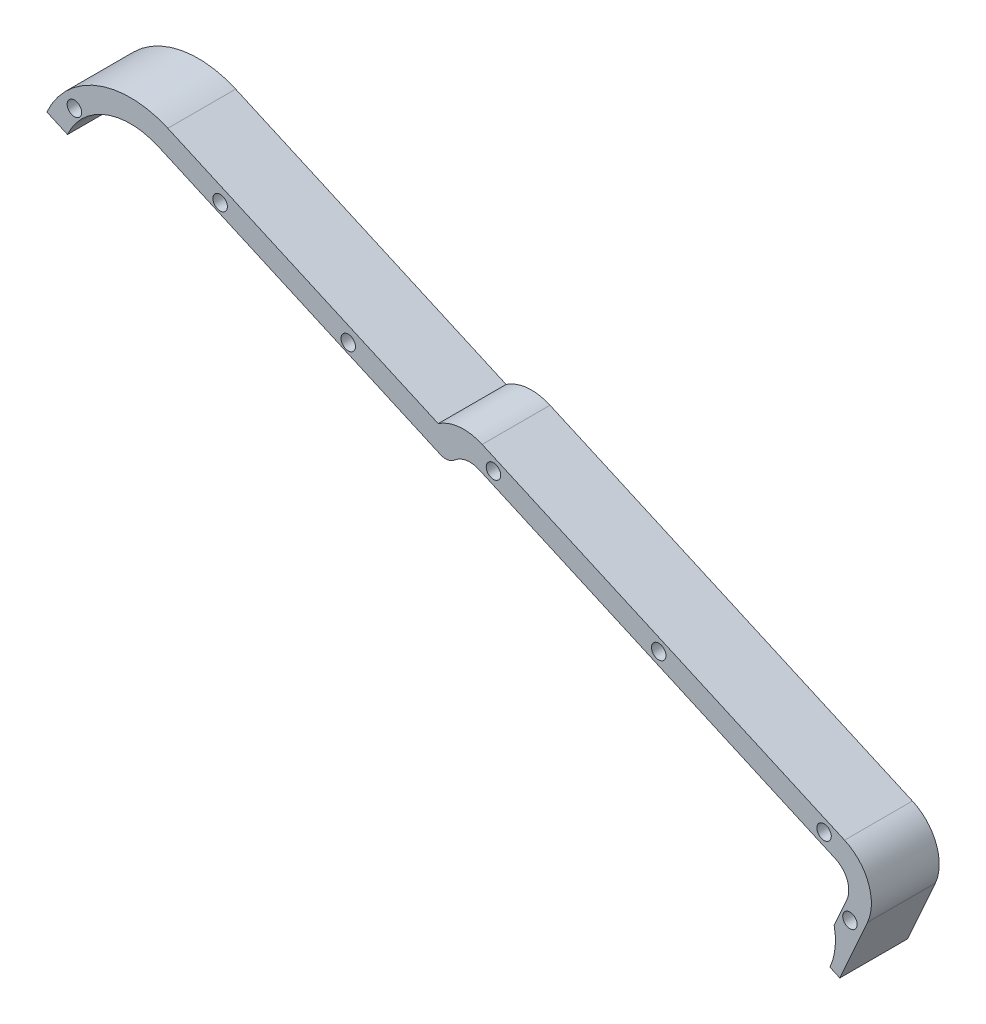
ISO-10303-21;
HEADER;
FILE_DESCRIPTION(('STEP AP214'),'2;1');
FILE_NAME('part.step','',(''),(''),'','','');
FILE_SCHEMA(('AUTOMOTIVE_DESIGN { 1 0 10303 214 1 1 1 1 }'));
ENDSEC;
DATA;
#1=APPLICATION_CONTEXT('core data for automotive mechanical design processes');
#2=APPLICATION_PROTOCOL_DEFINITION('international standard','automotive_design',2000,#1);
#3=PRODUCT_CONTEXT('',#1,'mechanical');
#4=PRODUCT('Part','Part','',(#3));
#5=PRODUCT_RELATED_PRODUCT_CATEGORY('part','',(#4));
#6=PRODUCT_DEFINITION_FORMATION('','',#4);
#7=PRODUCT_DEFINITION_CONTEXT('part definition',#1,'design');
#8=PRODUCT_DEFINITION('design','',#6,#7);
#9=PRODUCT_DEFINITION_SHAPE('','',#8);
#10=(LENGTH_UNIT() NAMED_UNIT(*) SI_UNIT(.MILLI.,.METRE.));
#11=(NAMED_UNIT(*) PLANE_ANGLE_UNIT() SI_UNIT($,.RADIAN.));
#12=(NAMED_UNIT(*) SI_UNIT($,.STERADIAN.) SOLID_ANGLE_UNIT());
#13=UNCERTAINTY_MEASURE_WITH_UNIT(LENGTH_MEASURE(1.E-05),#10,'distance_accuracy_value','');
#14=(GEOMETRIC_REPRESENTATION_CONTEXT(3) GLOBAL_UNCERTAINTY_ASSIGNED_CONTEXT((#13)) GLOBAL_UNIT_ASSIGNED_CONTEXT((#10,
#11,#12)) REPRESENTATION_CONTEXT('',''));
#15=CARTESIAN_POINT('',(0.,0.,0.));
#16=DIRECTION('',(0.,0.,1.));
#17=DIRECTION('',(1.,0.,0.));
#18=AXIS2_PLACEMENT_3D('',#15,#16,#17);
#19=CARTESIAN_POINT('',(-76.7868238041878,81.7037234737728,0.));
#20=DIRECTION('',(0.,0.,1.));
#21=DIRECTION('',(1.,0.,0.));
#22=AXIS2_PLACEMENT_3D('',#19,#20,#21);
#23=CYLINDRICAL_SURFACE('',#22,5.00000000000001);
#24=CARTESIAN_POINT('',(-76.7868238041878,81.7037234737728,15.));
#25=DIRECTION('',(0.,0.,-1.));
#26=DIRECTION('',(-1.,0.,0.));
#27=AXIS2_PLACEMENT_3D('',#24,#25,#26);
#28=CIRCLE('',#27,5.00000000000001);
#29=CARTESIAN_POINT('',(-74.7510627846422,86.27052509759,15.));
#30=VERTEX_POINT('',#29);
#31=CARTESIAN_POINT('',(-72.2200221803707,79.6679624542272,15.));
#32=VERTEX_POINT('',#31);
#33=EDGE_CURVE('E178',#30,#32,#28,.T.);
#34=ORIENTED_EDGE('',*,*,#33,.F.);
#35=DIRECTION('',(0.,0.,1.));
#36=VECTOR('',#35,1.);
#37=CARTESIAN_POINT('',(-74.7510627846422,86.27052509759,0.));
#38=LINE('',#37,#36);
#39=CARTESIAN_POINT('',(-74.7510627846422,86.27052509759,0.));
#40=VERTEX_POINT('',#39);
#41=EDGE_CURVE('E11',#40,#30,#38,.T.);
#42=ORIENTED_EDGE('',*,*,#41,.F.);
#43=CARTESIAN_POINT('',(-76.7868238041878,81.7037234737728,0.));
#44=DIRECTION('',(0.,0.,-1.));
#45=DIRECTION('',(-1.,0.,0.));
#46=AXIS2_PLACEMENT_3D('',#43,#44,#45);
#47=CIRCLE('',#46,5.00000000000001);
#48=CARTESIAN_POINT('',(-72.2200221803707,79.6679624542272,0.));
#49=VERTEX_POINT('',#48);
#50=EDGE_CURVE('E223',#40,#49,#47,.T.);
#51=ORIENTED_EDGE('',*,*,#50,.T.);
#52=DIRECTION('',(0.,0.,1.));
#53=VECTOR('',#52,1.);
#54=CARTESIAN_POINT('',(-72.2200221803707,79.6679624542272,0.));
#55=LINE('',#54,#53);
#56=EDGE_CURVE('E36',#49,#32,#55,.T.);
#57=ORIENTED_EDGE('',*,*,#56,.T.);
#58=EDGE_LOOP('',(#34,#42,#51,#57));
#59=FACE_BOUND('',#58,.T.);
#60=ADVANCED_FACE('F33',(#59),#23,.F.);
#61=CARTESIAN_POINT('',(-153.49279007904,121.371532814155,0.));
#62=DIRECTION('',(-0.40715220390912,-0.913360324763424,0.));
#63=DIRECTION('',(0.913360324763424,-0.40715220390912,0.));
#64=AXIS2_PLACEMENT_3D('',#61,#62,#63);
#65=PLANE('',#64);
#66=DIRECTION('',(0.913360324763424,-0.40715220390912,0.));
#67=VECTOR('',#66,1.);
#68=CARTESIAN_POINT('',(-153.49279007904,121.371532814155,15.));
#69=LINE('',#68,#67);
#70=CARTESIAN_POINT('',(-153.49279007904,121.371532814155,15.));
#71=VERTEX_POINT('',#70);
#72=EDGE_CURVE('E221',#71,#30,#69,.T.);
#73=ORIENTED_EDGE('',*,*,#72,.F.);
#74=DIRECTION('',(0.,0.,1.));
#75=VECTOR('',#74,1.);
#76=CARTESIAN_POINT('',(-153.49279007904,121.371532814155,0.));
#77=LINE('',#76,#75);
#78=CARTESIAN_POINT('',(-153.49279007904,121.371532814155,0.));
#79=VERTEX_POINT('',#78);
#80=EDGE_CURVE('E42',#79,#71,#77,.T.);
#81=ORIENTED_EDGE('',*,*,#80,.F.);
#82=DIRECTION('',(0.913360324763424,-0.40715220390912,0.));
#83=VECTOR('',#82,1.);
#84=CARTESIAN_POINT('',(-153.49279007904,121.371532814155,0.));
#85=LINE('',#84,#83);
#86=EDGE_CURVE('E168',#79,#40,#85,.T.);
#87=ORIENTED_EDGE('',*,*,#86,.T.);
#88=ORIENTED_EDGE('',*,*,#41,.T.);
#89=EDGE_LOOP('',(#73,#81,#87,#88));
#90=FACE_BOUND('',#89,.T.);
#91=ADVANCED_FACE('F251',(#90),#65,.T.);
#92=CARTESIAN_POINT('',(-155.528551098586,116.804731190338,0.));
#93=DIRECTION('',(0.,0.,1.));
#94=DIRECTION('',(1.,0.,0.));
#95=AXIS2_PLACEMENT_3D('',#92,#93,#94);
#96=CYLINDRICAL_SURFACE('',#95,5.00000000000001);
#97=CARTESIAN_POINT('',(-155.528551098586,116.804731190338,15.));
#98=DIRECTION('',(0.,0.,-1.));
#99=DIRECTION('',(-1.,0.,0.));
#100=AXIS2_PLACEMENT_3D('',#97,#98,#99);
#101=CIRCLE('',#100,5.00000000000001);
#102=CARTESIAN_POINT('',(-158.874492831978,120.520195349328,15.));
#103=VERTEX_POINT('',#102);
#104=EDGE_CURVE('E155',#103,#71,#101,.T.);
#105=ORIENTED_EDGE('',*,*,#104,.F.);
#106=DIRECTION('',(0.,0.,1.));
#107=VECTOR('',#106,1.);
#108=CARTESIAN_POINT('',(-158.874492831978,120.520195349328,0.));
#109=LINE('',#108,#107);
#110=CARTESIAN_POINT('',(-158.874492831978,120.520195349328,0.));
#111=VERTEX_POINT('',#110);
#112=EDGE_CURVE('E150',#111,#103,#109,.T.);
#113=ORIENTED_EDGE('',*,*,#112,.F.);
#114=CARTESIAN_POINT('',(-155.528551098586,116.804731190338,0.));
#115=DIRECTION('',(0.,0.,-1.));
#116=DIRECTION('',(-1.,0.,0.));
#117=AXIS2_PLACEMENT_3D('',#114,#115,#116);
#118=CIRCLE('',#117,5.00000000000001);
#119=EDGE_CURVE('E153',#111,#79,#118,.T.);
#120=ORIENTED_EDGE('',*,*,#119,.T.);
#121=ORIENTED_EDGE('',*,*,#80,.T.);
#122=EDGE_LOOP('',(#105,#113,#120,#121));
#123=FACE_BOUND('',#122,.T.);
#124=ADVANCED_FACE('F152',(#123),#96,.F.);
#125=CARTESIAN_POINT('',(-160.882057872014,122.749473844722,0.));
#126=DIRECTION('',(0.,0.,1.));
#127=DIRECTION('',(1.,0.,0.));
#128=AXIS2_PLACEMENT_3D('',#125,#126,#127);
#129=CYLINDRICAL_SURFACE('',#128,3.);
#130=CARTESIAN_POINT('',(-160.882057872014,122.749473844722,15.));
#131=DIRECTION('',(0.,0.,1.));
#132=DIRECTION('',(1.,0.,0.));
#133=AXIS2_PLACEMENT_3D('',#130,#131,#132);
#134=CIRCLE('',#133,3.);
#135=CARTESIAN_POINT('',(-162.103514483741,120.009392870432,15.));
#136=VERTEX_POINT('',#135);
#137=EDGE_CURVE('E218',#136,#103,#134,.T.);
#138=ORIENTED_EDGE('',*,*,#137,.F.);
#139=DIRECTION('',(0.,0.,1.));
#140=VECTOR('',#139,1.);
#141=CARTESIAN_POINT('',(-162.103514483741,120.009392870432,0.));
#142=LINE('',#141,#140);
#143=CARTESIAN_POINT('',(-162.103514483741,120.009392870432,0.));
#144=VERTEX_POINT('',#143);
#145=EDGE_CURVE('E160',#144,#136,#142,.T.);
#146=ORIENTED_EDGE('',*,*,#145,.F.);
#147=CARTESIAN_POINT('',(-160.882057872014,122.749473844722,0.));
#148=DIRECTION('',(0.,0.,1.));
#149=DIRECTION('',(1.,0.,0.));
#150=AXIS2_PLACEMENT_3D('',#147,#148,#149);
#151=CIRCLE('',#150,3.);
#152=EDGE_CURVE('E166',#144,#111,#151,.T.);
#153=ORIENTED_EDGE('',*,*,#152,.T.);
#154=ORIENTED_EDGE('',*,*,#112,.T.);
#155=EDGE_LOOP('',(#138,#146,#153,#154));
#156=FACE_BOUND('',#155,.T.);
#157=ADVANCED_FACE('F170',(#156),#129,.T.);
#158=CARTESIAN_POINT('',(-224.335121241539,147.750619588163,0.));
#159=DIRECTION('',(-0.40715220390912,-0.913360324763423,0.));
#160=DIRECTION('',(0.913360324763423,-0.40715220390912,0.));
#161=AXIS2_PLACEMENT_3D('',#158,#159,#160);
#162=PLANE('',#161);
#163=DIRECTION('',(0.913360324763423,-0.40715220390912,0.));
#164=VECTOR('',#163,1.);
#165=CARTESIAN_POINT('',(-224.335121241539,147.750619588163,15.));
#166=LINE('',#165,#164);
#167=CARTESIAN_POINT('',(-224.335121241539,147.750619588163,15.));
#168=VERTEX_POINT('',#167);
#169=EDGE_CURVE('E215',#168,#136,#166,.T.);
#170=ORIENTED_EDGE('',*,*,#169,.F.);
#171=DIRECTION('',(0.,0.,1.));
#172=VECTOR('',#171,1.);
#173=CARTESIAN_POINT('',(-224.335121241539,147.750619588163,0.));
#174=LINE('',#173,#172);
#175=CARTESIAN_POINT('',(-224.335121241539,147.750619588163,0.));
#176=VERTEX_POINT('',#175);
#177=EDGE_CURVE('E227',#176,#168,#174,.T.);
#178=ORIENTED_EDGE('',*,*,#177,.F.);
#179=DIRECTION('',(0.913360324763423,-0.40715220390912,0.));
#180=VECTOR('',#179,1.);
#181=CARTESIAN_POINT('',(-224.335121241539,147.750619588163,0.));
#182=LINE('',#181,#180);
#183=EDGE_CURVE('E171',#176,#144,#182,.T.);
#184=ORIENTED_EDGE('',*,*,#183,.T.);
#185=ORIENTED_EDGE('',*,*,#145,.T.);
#186=EDGE_LOOP('',(#170,#178,#184,#185));
#187=FACE_BOUND('',#186,.T.);
#188=ADVANCED_FACE('F264',(#187),#162,.T.);
#189=CARTESIAN_POINT('',(-230.544192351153,133.821874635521,0.));
#190=DIRECTION('',(0.,0.,1.));
#191=DIRECTION('',(1.,0.,0.));
#192=AXIS2_PLACEMENT_3D('',#189,#190,#191);
#193=CYLINDRICAL_SURFACE('',#192,15.25);
#194=CARTESIAN_POINT('',(-230.544192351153,133.821874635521,15.));
#195=DIRECTION('',(0.,0.,-1.));
#196=DIRECTION('',(-1.,0.,0.));
#197=AXIS2_PLACEMENT_3D('',#194,#195,#196);
#198=CIRCLE('',#197,15.25);
#199=CARTESIAN_POINT('',(-244.472937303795,140.030945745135,15.));
#200=VERTEX_POINT('',#199);
#201=EDGE_CURVE('E212',#200,#168,#198,.T.);
#202=ORIENTED_EDGE('',*,*,#201,.F.);
#203=DIRECTION('',(0.,0.,1.));
#204=VECTOR('',#203,1.);
#205=CARTESIAN_POINT('',(-244.472937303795,140.030945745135,0.));
#206=LINE('',#205,#204);
#207=CARTESIAN_POINT('',(-244.472937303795,140.030945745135,0.));
#208=VERTEX_POINT('',#207);
#209=EDGE_CURVE('E229',#208,#200,#206,.T.);
#210=ORIENTED_EDGE('',*,*,#209,.F.);
#211=CARTESIAN_POINT('',(-230.544192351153,133.821874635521,0.));
#212=DIRECTION('',(0.,0.,-1.));
#213=DIRECTION('',(-1.,0.,0.));
#214=AXIS2_PLACEMENT_3D('',#211,#212,#213);
#215=CIRCLE('',#214,15.25);
#216=EDGE_CURVE('E173',#208,#176,#215,.T.);
#217=ORIENTED_EDGE('',*,*,#216,.T.);
#218=ORIENTED_EDGE('',*,*,#177,.T.);
#219=EDGE_LOOP('',(#202,#210,#217,#218));
#220=FACE_BOUND('',#219,.T.);
#221=ADVANCED_FACE('F267',(#220),#193,.F.);
#222=CARTESIAN_POINT('',(-249.039738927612,142.066706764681,0.));
#223=DIRECTION('',(-0.407152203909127,-0.913360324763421,0.));
#224=DIRECTION('',(0.913360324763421,-0.407152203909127,0.));
#225=AXIS2_PLACEMENT_3D('',#222,#223,#224);
#226=PLANE('',#225);
#227=DIRECTION('',(0.91336032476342,-0.407152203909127,0.));
#228=VECTOR('',#227,1.);
#229=CARTESIAN_POINT('',(-249.039738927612,142.066706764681,15.));
#230=LINE('',#229,#228);
#231=CARTESIAN_POINT('',(-249.039738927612,142.066706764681,15.));
#232=VERTEX_POINT('',#231);
#233=EDGE_CURVE('E209',#232,#200,#230,.T.);
#234=ORIENTED_EDGE('',*,*,#233,.F.);
#235=DIRECTION('',(0.,0.,1.));
#236=VECTOR('',#235,1.);
#237=CARTESIAN_POINT('',(-249.039738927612,142.066706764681,0.));
#238=LINE('',#237,#236);
#239=CARTESIAN_POINT('',(-249.039738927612,142.066706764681,0.));
#240=VERTEX_POINT('',#239);
#241=EDGE_CURVE('E231',#240,#232,#238,.T.);
#242=ORIENTED_EDGE('',*,*,#241,.F.);
#243=DIRECTION('',(0.91336032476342,-0.407152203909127,0.));
#244=VECTOR('',#243,1.);
#245=CARTESIAN_POINT('',(-249.039738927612,142.066706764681,0.));
#246=LINE('',#245,#244);
#247=EDGE_CURVE('E419',#240,#208,#246,.T.);
#248=ORIENTED_EDGE('',*,*,#247,.T.);
#249=ORIENTED_EDGE('',*,*,#209,.T.);
#250=EDGE_LOOP('',(#234,#242,#248,#249));
#251=FACE_BOUND('',#250,.T.);
#252=ADVANCED_FACE('F271',(#251),#226,.T.);
#253=CARTESIAN_POINT('',(-230.544192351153,133.821874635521,0.));
#254=DIRECTION('',(0.,0.,1.));
#255=DIRECTION('',(1.,0.,0.));
#256=AXIS2_PLACEMENT_3D('',#253,#254,#255);
#257=CYLINDRICAL_SURFACE('',#256,20.25);
#258=CARTESIAN_POINT('',(-230.544192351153,133.821874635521,15.));
#259=DIRECTION('',(0.,0.,1.));
#260=DIRECTION('',(1.,0.,0.));
#261=AXIS2_PLACEMENT_3D('',#258,#259,#260);
#262=CIRCLE('',#261,20.25);
#263=CARTESIAN_POINT('',(-222.299360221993,152.317421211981,15.));
#264=VERTEX_POINT('',#263);
#265=EDGE_CURVE('E206',#264,#232,#262,.T.);
#266=ORIENTED_EDGE('',*,*,#265,.F.);
#267=DIRECTION('',(0.,0.,1.));
#268=VECTOR('',#267,1.);
#269=CARTESIAN_POINT('',(-222.299360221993,152.317421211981,0.));
#270=LINE('',#269,#268);
#271=CARTESIAN_POINT('',(-222.299360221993,152.317421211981,0.));
#272=VERTEX_POINT('',#271);
#273=EDGE_CURVE('E233',#272,#264,#270,.T.);
#274=ORIENTED_EDGE('',*,*,#273,.F.);
#275=CARTESIAN_POINT('',(-230.544192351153,133.821874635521,0.));
#276=DIRECTION('',(0.,0.,1.));
#277=DIRECTION('',(1.,0.,0.));
#278=AXIS2_PLACEMENT_3D('',#275,#276,#277);
#279=CIRCLE('',#278,20.25);
#280=EDGE_CURVE('E416',#272,#240,#279,.T.);
#281=ORIENTED_EDGE('',*,*,#280,.T.);
#282=ORIENTED_EDGE('',*,*,#241,.T.);
#283=EDGE_LOOP('',(#266,#274,#281,#282));
#284=FACE_BOUND('',#283,.T.);
#285=ADVANCED_FACE('F275',(#284),#257,.T.);
#286=CARTESIAN_POINT('',(-162.524605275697,125.671394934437,0.));
#287=DIRECTION('',(0.407152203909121,0.913360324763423,0.));
#288=DIRECTION('',(-0.913360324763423,0.407152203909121,0.));
#289=AXIS2_PLACEMENT_3D('',#286,#287,#288);
#290=PLANE('',#289);
#291=DIRECTION('',(-0.913360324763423,0.407152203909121,0.));
#292=VECTOR('',#291,1.);
#293=CARTESIAN_POINT('',(-162.524605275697,125.671394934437,15.));
#294=LINE('',#293,#292);
#295=CARTESIAN_POINT('',(-162.524605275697,125.671394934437,15.));
#296=VERTEX_POINT('',#295);
#297=EDGE_CURVE('E203',#296,#264,#294,.T.);
#298=ORIENTED_EDGE('',*,*,#297,.F.);
#299=DIRECTION('',(0.,0.,1.));
#300=VECTOR('',#299,1.);
#301=CARTESIAN_POINT('',(-162.524605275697,125.671394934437,0.));
#302=LINE('',#301,#300);
#303=CARTESIAN_POINT('',(-162.524605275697,125.671394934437,0.));
#304=VERTEX_POINT('',#303);
#305=EDGE_CURVE('E235',#304,#296,#302,.T.);
#306=ORIENTED_EDGE('',*,*,#305,.F.);
#307=DIRECTION('',(-0.913360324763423,0.407152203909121,0.));
#308=VECTOR('',#307,1.);
#309=CARTESIAN_POINT('',(-162.524605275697,125.671394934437,0.));
#310=LINE('',#309,#308);
#311=EDGE_CURVE('E413',#304,#272,#310,.T.);
#312=ORIENTED_EDGE('',*,*,#311,.T.);
#313=ORIENTED_EDGE('',*,*,#273,.T.);
#314=EDGE_LOOP('',(#298,#306,#312,#313));
#315=FACE_BOUND('',#314,.T.);
#316=ADVANCED_FACE('F279',(#315),#290,.T.);
#317=CARTESIAN_POINT('',(-156.88852428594,117.410971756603,0.));
#318=DIRECTION('',(0.,0.,1.));
#319=DIRECTION('',(1.,0.,0.));
#320=AXIS2_PLACEMENT_3D('',#317,#318,#319);
#321=CYLINDRICAL_SURFACE('',#320,10.);
#322=CARTESIAN_POINT('',(-156.88852428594,117.410971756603,15.));
#323=DIRECTION('',(0.,0.,1.));
#324=DIRECTION('',(1.,0.,0.));
#325=AXIS2_PLACEMENT_3D('',#322,#323,#324);
#326=CIRCLE('',#325,10.);
#327=CARTESIAN_POINT('',(-152.817002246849,126.544575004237,15.));
#328=VERTEX_POINT('',#327);
#329=EDGE_CURVE('E200',#328,#296,#326,.T.);
#330=ORIENTED_EDGE('',*,*,#329,.F.);
#331=DIRECTION('',(0.,0.,1.));
#332=VECTOR('',#331,1.);
#333=CARTESIAN_POINT('',(-152.817002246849,126.544575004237,0.));
#334=LINE('',#333,#332);
#335=CARTESIAN_POINT('',(-152.817002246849,126.544575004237,0.));
#336=VERTEX_POINT('',#335);
#337=EDGE_CURVE('E237',#336,#328,#334,.T.);
#338=ORIENTED_EDGE('',*,*,#337,.F.);
#339=CARTESIAN_POINT('',(-156.88852428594,117.410971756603,0.));
#340=DIRECTION('',(0.,0.,1.));
#341=DIRECTION('',(1.,0.,0.));
#342=AXIS2_PLACEMENT_3D('',#339,#340,#341);
#343=CIRCLE('',#342,10.);
#344=EDGE_CURVE('E410',#336,#304,#343,.T.);
#345=ORIENTED_EDGE('',*,*,#344,.T.);
#346=ORIENTED_EDGE('',*,*,#305,.T.);
#347=EDGE_LOOP('',(#330,#338,#345,#346));
#348=FACE_BOUND('',#347,.T.);
#349=ADVANCED_FACE('F283',(#348),#321,.T.);
#350=CARTESIAN_POINT('',(-72.7153017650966,90.837326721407,0.));
#351=DIRECTION('',(0.40715220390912,0.913360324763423,0.));
#352=DIRECTION('',(-0.913360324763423,0.40715220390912,0.));
#353=AXIS2_PLACEMENT_3D('',#350,#351,#352);
#354=PLANE('',#353);
#355=DIRECTION('',(-0.913360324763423,0.40715220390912,0.));
#356=VECTOR('',#355,1.);
#357=CARTESIAN_POINT('',(-72.7153017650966,90.837326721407,15.));
#358=LINE('',#357,#356);
#359=CARTESIAN_POINT('',(-72.7153017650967,90.8373267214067,15.));
#360=VERTEX_POINT('',#359);
#361=EDGE_CURVE('E197',#360,#328,#358,.T.);
#362=ORIENTED_EDGE('',*,*,#361,.F.);
#363=DIRECTION('',(0.,0.,1.));
#364=VECTOR('',#363,1.);
#365=CARTESIAN_POINT('',(-72.7153017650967,90.8373267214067,0.));
#366=LINE('',#365,#364);
#367=CARTESIAN_POINT('',(-72.7153017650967,90.8373267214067,0.));
#368=VERTEX_POINT('',#367);
#369=EDGE_CURVE('E239',#368,#360,#366,.T.);
#370=ORIENTED_EDGE('',*,*,#369,.F.);
#371=DIRECTION('',(-0.913360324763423,0.40715220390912,0.));
#372=VECTOR('',#371,1.);
#373=CARTESIAN_POINT('',(-72.7153017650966,90.837326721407,0.));
#374=LINE('',#373,#372);
#375=EDGE_CURVE('E407',#368,#336,#374,.T.);
#376=ORIENTED_EDGE('',*,*,#375,.T.);
#377=ORIENTED_EDGE('',*,*,#337,.T.);
#378=EDGE_LOOP('',(#362,#370,#376,#377));
#379=FACE_BOUND('',#378,.T.);
#380=ADVANCED_FACE('F287',(#379),#354,.T.);
#381=CARTESIAN_POINT('',(-76.7868238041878,81.7037234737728,0.));
#382=DIRECTION('',(0.,0.,1.));
#383=DIRECTION('',(1.,0.,0.));
#384=AXIS2_PLACEMENT_3D('',#381,#382,#383);
#385=CYLINDRICAL_SURFACE('',#384,9.99999999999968);
#386=CARTESIAN_POINT('',(-76.7868238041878,81.7037234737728,15.));
#387=DIRECTION('',(0.,0.,1.));
#388=DIRECTION('',(1.,0.,0.));
#389=AXIS2_PLACEMENT_3D('',#386,#387,#388);
#390=CIRCLE('',#389,9.99999999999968);
#391=CARTESIAN_POINT('',(-67.6532205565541,77.6322014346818,15.));
#392=VERTEX_POINT('',#391);
#393=EDGE_CURVE('E194',#392,#360,#390,.T.);
#394=ORIENTED_EDGE('',*,*,#393,.F.);
#395=DIRECTION('',(0.,0.,1.));
#396=VECTOR('',#395,1.);
#397=CARTESIAN_POINT('',(-67.6532205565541,77.6322014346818,0.));
#398=LINE('',#397,#396);
#399=CARTESIAN_POINT('',(-67.6532205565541,77.6322014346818,0.));
#400=VERTEX_POINT('',#399);
#401=EDGE_CURVE('E241',#400,#392,#398,.T.);
#402=ORIENTED_EDGE('',*,*,#401,.F.);
#403=CARTESIAN_POINT('',(-76.7868238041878,81.7037234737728,0.));
#404=DIRECTION('',(0.,0.,1.));
#405=DIRECTION('',(1.,0.,0.));
#406=AXIS2_PLACEMENT_3D('',#403,#404,#405);
#407=CIRCLE('',#406,9.99999999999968);
#408=EDGE_CURVE('E404',#400,#368,#407,.T.);
#409=ORIENTED_EDGE('',*,*,#408,.T.);
#410=ORIENTED_EDGE('',*,*,#369,.T.);
#411=EDGE_LOOP('',(#394,#402,#409,#410));
#412=FACE_BOUND('',#411,.T.);
#413=ADVANCED_FACE('F291',(#412),#385,.T.);
#414=CARTESIAN_POINT('',(-73.7605036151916,63.9317965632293,0.));
#415=DIRECTION('',(0.91336032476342,-0.407152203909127,0.));
#416=DIRECTION('',(0.407152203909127,0.91336032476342,0.));
#417=AXIS2_PLACEMENT_3D('',#414,#415,#416);
#418=PLANE('',#417);
#419=DIRECTION('',(0.407152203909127,0.91336032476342,0.));
#420=VECTOR('',#419,1.);
#421=CARTESIAN_POINT('',(-73.7605036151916,63.9317965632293,15.));
#422=LINE('',#421,#420);
#423=CARTESIAN_POINT('',(-73.7605036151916,63.9317965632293,15.));
#424=VERTEX_POINT('',#423);
#425=EDGE_CURVE('E191',#424,#392,#422,.T.);
#426=ORIENTED_EDGE('',*,*,#425,.F.);
#427=DIRECTION('',(0.,0.,1.));
#428=VECTOR('',#427,1.);
#429=CARTESIAN_POINT('',(-73.7605036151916,63.9317965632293,0.));
#430=LINE('',#429,#428);
#431=CARTESIAN_POINT('',(-73.7605036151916,63.9317965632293,0.));
#432=VERTEX_POINT('',#431);
#433=EDGE_CURVE('E243',#432,#424,#430,.T.);
#434=ORIENTED_EDGE('',*,*,#433,.F.);
#435=DIRECTION('',(0.407152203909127,0.91336032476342,0.));
#436=VECTOR('',#435,1.);
#437=CARTESIAN_POINT('',(-73.7605036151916,63.9317965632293,0.));
#438=LINE('',#437,#436);
#439=EDGE_CURVE('E401',#432,#400,#438,.T.);
#440=ORIENTED_EDGE('',*,*,#439,.T.);
#441=ORIENTED_EDGE('',*,*,#401,.T.);
#442=EDGE_LOOP('',(#426,#434,#440,#441));
#443=FACE_BOUND('',#442,.T.);
#444=ADVANCED_FACE('F295',(#443),#418,.T.);
#445=CARTESIAN_POINT('',(-75.9417065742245,64.9041199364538,0.));
#446=DIRECTION('',(-0.407152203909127,-0.91336032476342,0.));
#447=DIRECTION('',(0.91336032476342,-0.407152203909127,0.));
#448=AXIS2_PLACEMENT_3D('',#445,#446,#447);
#449=PLANE('',#448);
#450=DIRECTION('',(0.91336032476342,-0.407152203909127,0.));
#451=VECTOR('',#450,1.);
#452=CARTESIAN_POINT('',(-75.9417065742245,64.9041199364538,15.));
#453=LINE('',#452,#451);
#454=CARTESIAN_POINT('',(-75.9417065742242,64.9041199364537,15.));
#455=VERTEX_POINT('',#454);
#456=EDGE_CURVE('E188',#455,#424,#453,.T.);
#457=ORIENTED_EDGE('',*,*,#456,.F.);
#458=DIRECTION('',(0.,0.,1.));
#459=VECTOR('',#458,1.);
#460=CARTESIAN_POINT('',(-75.9417065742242,64.9041199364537,0.));
#461=LINE('',#460,#459);
#462=CARTESIAN_POINT('',(-75.9417065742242,64.9041199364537,0.));
#463=VERTEX_POINT('',#462);
#464=EDGE_CURVE('E245',#463,#455,#461,.T.);
#465=ORIENTED_EDGE('',*,*,#464,.F.);
#466=DIRECTION('',(0.91336032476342,-0.407152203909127,0.));
#467=VECTOR('',#466,1.);
#468=CARTESIAN_POINT('',(-75.9417065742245,64.9041199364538,0.));
#469=LINE('',#468,#467);
#470=EDGE_CURVE('E398',#463,#432,#469,.T.);
#471=ORIENTED_EDGE('',*,*,#470,.T.);
#472=ORIENTED_EDGE('',*,*,#433,.T.);
#473=EDGE_LOOP('',(#457,#465,#471,#472));
#474=FACE_BOUND('',#473,.T.);
#475=ADVANCED_FACE('F299',(#474),#449,.T.);
#476=CARTESIAN_POINT('',(-88.7287511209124,70.6042507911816,0.));
#477=DIRECTION('',(0.,0.,1.));
#478=DIRECTION('',(1.,0.,0.));
#479=AXIS2_PLACEMENT_3D('',#476,#477,#478);
#480=CYLINDRICAL_SURFACE('',#479,14.0000000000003);
#481=CARTESIAN_POINT('',(-88.7287511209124,70.6042507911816,15.));
#482=DIRECTION('',(0.,0.,-1.));
#483=DIRECTION('',(-1.,0.,0.));
#484=AXIS2_PLACEMENT_3D('',#481,#482,#483);
#485=CIRCLE('',#484,14.0000000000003);
#486=CARTESIAN_POINT('',(-75.0118010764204,73.4051937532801,15.));
#487=VERTEX_POINT('',#486);
#488=EDGE_CURVE('E185',#487,#455,#485,.T.);
#489=ORIENTED_EDGE('',*,*,#488,.F.);
#490=DIRECTION('',(0.,0.,1.));
#491=VECTOR('',#490,1.);
#492=CARTESIAN_POINT('',(-75.0118010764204,73.4051937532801,0.));
#493=LINE('',#492,#491);
#494=CARTESIAN_POINT('',(-75.0118010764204,73.4051937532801,0.));
#495=VERTEX_POINT('',#494);
#496=EDGE_CURVE('E246',#495,#487,#493,.T.);
#497=ORIENTED_EDGE('',*,*,#496,.F.);
#498=CARTESIAN_POINT('',(-88.7287511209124,70.6042507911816,0.));
#499=DIRECTION('',(0.,0.,-1.));
#500=DIRECTION('',(-1.,0.,0.));
#501=AXIS2_PLACEMENT_3D('',#498,#499,#500);
#502=CIRCLE('',#501,14.0000000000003);
#503=EDGE_CURVE('E395',#495,#463,#502,.T.);
#504=ORIENTED_EDGE('',*,*,#503,.T.);
#505=ORIENTED_EDGE('',*,*,#464,.T.);
#506=EDGE_LOOP('',(#489,#497,#504,#505));
#507=FACE_BOUND('',#506,.T.);
#508=ADVANCED_FACE('F303',(#507),#480,.F.);
#509=CARTESIAN_POINT('',(-72.2200221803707,79.6679624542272,0.));
#510=DIRECTION('',(-0.913360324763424,0.407152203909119,0.));
#511=DIRECTION('',(-0.407152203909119,-0.913360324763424,0.));
#512=AXIS2_PLACEMENT_3D('',#509,#510,#511);
#513=PLANE('',#512);
#514=DIRECTION('',(-0.407152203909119,-0.913360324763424,0.));
#515=VECTOR('',#514,1.);
#516=CARTESIAN_POINT('',(-72.2200221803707,79.6679624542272,15.));
#517=LINE('',#516,#515);
#518=EDGE_CURVE('E181',#32,#487,#517,.T.);
#519=ORIENTED_EDGE('',*,*,#518,.F.);
#520=ORIENTED_EDGE('',*,*,#56,.F.);
#521=DIRECTION('',(-0.407152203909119,-0.913360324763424,0.));
#522=VECTOR('',#521,1.);
#523=CARTESIAN_POINT('',(-72.2200221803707,79.6679624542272,0.));
#524=LINE('',#523,#522);
#525=EDGE_CURVE('E393',#49,#495,#524,.T.);
#526=ORIENTED_EDGE('',*,*,#525,.T.);
#527=ORIENTED_EDGE('',*,*,#496,.T.);
#528=EDGE_LOOP('',(#519,#520,#526,#527));
#529=FACE_BOUND('',#528,.T.);
#530=ADVANCED_FACE('F248',(#529),#513,.T.);
#531=CARTESIAN_POINT('',(-76.7868238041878,81.7037234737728,0.));
#532=DIRECTION('',(0.,0.,-1.));
#533=DIRECTION('',(-1.,0.,0.));
#534=AXIS2_PLACEMENT_3D('',#531,#532,#533);
#535=PLANE('',#534);
#536=CARTESIAN_POINT('',(-242.947351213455,145.810375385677,0.));
#537=DIRECTION('',(0.,0.,1.));
#538=DIRECTION('',(-1.,0.,0.));
#539=AXIS2_PLACEMENT_3D('',#536,#537,#538);
#540=CIRCLE('',#539,1.59999999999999);
#541=CARTESIAN_POINT('',(-241.347351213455,145.810375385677,0.));
#542=VERTEX_POINT('',#541);
#543=EDGE_CURVE('E350',#542,#542,#540,.T.);
#544=ORIENTED_EDGE('',*,*,#543,.T.);
#545=EDGE_LOOP('',(#544));
#546=FACE_BOUND('',#545,.T.);
#547=CARTESIAN_POINT('',(-182.419602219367,131.25549106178,0.));
#548=DIRECTION('',(0.,0.,1.));
#549=DIRECTION('',(-1.,0.,0.));
#550=AXIS2_PLACEMENT_3D('',#547,#548,#549);
#551=CIRCLE('',#550,1.59999999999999);
#552=CARTESIAN_POINT('',(-180.819602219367,131.25549106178,0.));
#553=VERTEX_POINT('',#552);
#554=EDGE_CURVE('E358',#553,#553,#551,.T.);
#555=ORIENTED_EDGE('',*,*,#554,.T.);
#556=EDGE_LOOP('',(#555));
#557=FACE_BOUND('',#556,.T.);
#558=CARTESIAN_POINT('',(-210.733772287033,143.877209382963,0.));
#559=DIRECTION('',(0.,0.,1.));
#560=DIRECTION('',(-1.,0.,0.));
#561=AXIS2_PLACEMENT_3D('',#558,#559,#560);
#562=CIRCLE('',#561,1.59999999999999);
#563=CARTESIAN_POINT('',(-209.133772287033,143.877209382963,0.));
#564=VERTEX_POINT('',#563);
#565=EDGE_CURVE('E364',#564,#564,#562,.T.);
#566=ORIENTED_EDGE('',*,*,#565,.T.);
#567=EDGE_LOOP('',(#566));
#568=FACE_BOUND('',#567,.T.);
#569=CARTESIAN_POINT('',(-71.5234221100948,76.0728618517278,0.));
#570=DIRECTION('',(0.,0.,1.));
#571=DIRECTION('',(-1.,0.,0.));
#572=AXIS2_PLACEMENT_3D('',#569,#570,#571);
#573=CIRCLE('',#572,1.6);
#574=CARTESIAN_POINT('',(-69.9234221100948,76.0728618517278,0.));
#575=VERTEX_POINT('',#574);
#576=EDGE_CURVE('E370',#575,#575,#573,.T.);
#577=ORIENTED_EDGE('',*,*,#576,.T.);
#578=EDGE_LOOP('',(#577));
#579=FACE_BOUND('',#578,.T.);
#580=CARTESIAN_POINT('',(-77.2496195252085,90.1214618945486,0.));
#581=DIRECTION('',(0.,0.,1.));
#582=DIRECTION('',(-1.,0.,0.));
#583=AXIS2_PLACEMENT_3D('',#580,#581,#582);
#584=CIRCLE('',#583,1.6);
#585=CARTESIAN_POINT('',(-75.6496195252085,90.1214618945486,0.));
#586=VERTEX_POINT('',#585);
#587=EDGE_CURVE('E376',#586,#586,#584,.T.);
#588=ORIENTED_EDGE('',*,*,#587,.T.);
#589=EDGE_LOOP('',(#588));
#590=FACE_BOUND('',#589,.T.);
#591=CARTESIAN_POINT('',(-150.318445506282,122.693638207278,0.));
#592=DIRECTION('',(0.,0.,1.));
#593=DIRECTION('',(-1.,0.,0.));
#594=AXIS2_PLACEMENT_3D('',#591,#592,#593);
#595=CIRCLE('',#594,1.59999999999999);
#596=CARTESIAN_POINT('',(-148.718445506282,122.693638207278,0.));
#597=VERTEX_POINT('',#596);
#598=EDGE_CURVE('E382',#597,#597,#595,.T.);
#599=ORIENTED_EDGE('',*,*,#598,.T.);
#600=EDGE_LOOP('',(#599));
#601=FACE_BOUND('',#600,.T.);
#602=CARTESIAN_POINT('',(-113.784032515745,106.407550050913,0.));
#603=DIRECTION('',(0.,0.,1.));
#604=DIRECTION('',(-1.,0.,0.));
#605=AXIS2_PLACEMENT_3D('',#602,#603,#604);
#606=CIRCLE('',#605,1.6);
#607=CARTESIAN_POINT('',(-112.184032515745,106.407550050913,0.));
#608=VERTEX_POINT('',#607);
#609=EDGE_CURVE('E182',#608,#608,#606,.T.);
#610=ORIENTED_EDGE('',*,*,#609,.T.);
#611=EDGE_LOOP('',(#610));
#612=FACE_BOUND('',#611,.T.);
#613=ORIENTED_EDGE('',*,*,#50,.F.);
#614=ORIENTED_EDGE('',*,*,#86,.F.);
#615=ORIENTED_EDGE('',*,*,#119,.F.);
#616=ORIENTED_EDGE('',*,*,#152,.F.);
#617=ORIENTED_EDGE('',*,*,#183,.F.);
#618=ORIENTED_EDGE('',*,*,#216,.F.);
#619=ORIENTED_EDGE('',*,*,#247,.F.);
#620=ORIENTED_EDGE('',*,*,#280,.F.);
#621=ORIENTED_EDGE('',*,*,#311,.F.);
#622=ORIENTED_EDGE('',*,*,#344,.F.);
#623=ORIENTED_EDGE('',*,*,#375,.F.);
#624=ORIENTED_EDGE('',*,*,#408,.F.);
#625=ORIENTED_EDGE('',*,*,#439,.F.);
#626=ORIENTED_EDGE('',*,*,#470,.F.);
#627=ORIENTED_EDGE('',*,*,#503,.F.);
#628=ORIENTED_EDGE('',*,*,#525,.F.);
#629=EDGE_LOOP('',(#613,#614,#615,#616,#617,#618,#619,#620,#621,#622,#623,#624,#625,#626,#627,#628));
#630=FACE_BOUND('',#629,.T.);
#631=ADVANCED_FACE('F164',(#546,#557,#568,#579,#590,#601,#612,#630),#535,.T.);
#632=CARTESIAN_POINT('',(-76.7868238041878,81.7037234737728,15.));
#633=DIRECTION('',(0.,0.,-1.));
#634=DIRECTION('',(-1.,0.,0.));
#635=AXIS2_PLACEMENT_3D('',#632,#633,#634);
#636=PLANE('',#635);
#637=CARTESIAN_POINT('',(-242.947351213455,145.810375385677,15.));
#638=DIRECTION('',(0.,0.,1.));
#639=DIRECTION('',(-1.,0.,0.));
#640=AXIS2_PLACEMENT_3D('',#637,#638,#639);
#641=CIRCLE('',#640,1.59999999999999);
#642=CARTESIAN_POINT('',(-241.347351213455,145.810375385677,15.));
#643=VERTEX_POINT('',#642);
#644=EDGE_CURVE('E353',#643,#643,#641,.T.);
#645=ORIENTED_EDGE('',*,*,#644,.F.);
#646=EDGE_LOOP('',(#645));
#647=FACE_BOUND('',#646,.T.);
#648=CARTESIAN_POINT('',(-182.419602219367,131.25549106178,15.));
#649=DIRECTION('',(0.,0.,1.));
#650=DIRECTION('',(-1.,0.,0.));
#651=AXIS2_PLACEMENT_3D('',#648,#649,#650);
#652=CIRCLE('',#651,1.59999999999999);
#653=CARTESIAN_POINT('',(-180.819602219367,131.25549106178,15.));
#654=VERTEX_POINT('',#653);
#655=EDGE_CURVE('E355',#654,#654,#652,.T.);
#656=ORIENTED_EDGE('',*,*,#655,.F.);
#657=EDGE_LOOP('',(#656));
#658=FACE_BOUND('',#657,.T.);
#659=CARTESIAN_POINT('',(-210.733772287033,143.877209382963,15.));
#660=DIRECTION('',(0.,0.,1.));
#661=DIRECTION('',(-1.,0.,0.));
#662=AXIS2_PLACEMENT_3D('',#659,#660,#661);
#663=CIRCLE('',#662,1.59999999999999);
#664=CARTESIAN_POINT('',(-209.133772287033,143.877209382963,15.));
#665=VERTEX_POINT('',#664);
#666=EDGE_CURVE('E361',#665,#665,#663,.T.);
#667=ORIENTED_EDGE('',*,*,#666,.F.);
#668=EDGE_LOOP('',(#667));
#669=FACE_BOUND('',#668,.T.);
#670=CARTESIAN_POINT('',(-71.5234221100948,76.0728618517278,15.));
#671=DIRECTION('',(0.,0.,1.));
#672=DIRECTION('',(-1.,0.,0.));
#673=AXIS2_PLACEMENT_3D('',#670,#671,#672);
#674=CIRCLE('',#673,1.6);
#675=CARTESIAN_POINT('',(-69.9234221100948,76.0728618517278,15.));
#676=VERTEX_POINT('',#675);
#677=EDGE_CURVE('E367',#676,#676,#674,.T.);
#678=ORIENTED_EDGE('',*,*,#677,.F.);
#679=EDGE_LOOP('',(#678));
#680=FACE_BOUND('',#679,.T.);
#681=CARTESIAN_POINT('',(-77.2496195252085,90.1214618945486,15.));
#682=DIRECTION('',(0.,0.,1.));
#683=DIRECTION('',(-1.,0.,0.));
#684=AXIS2_PLACEMENT_3D('',#681,#682,#683);
#685=CIRCLE('',#684,1.6);
#686=CARTESIAN_POINT('',(-75.6496195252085,90.1214618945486,15.));
#687=VERTEX_POINT('',#686);
#688=EDGE_CURVE('E373',#687,#687,#685,.T.);
#689=ORIENTED_EDGE('',*,*,#688,.F.);
#690=EDGE_LOOP('',(#689));
#691=FACE_BOUND('',#690,.T.);
#692=CARTESIAN_POINT('',(-150.318445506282,122.693638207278,15.));
#693=DIRECTION('',(0.,0.,1.));
#694=DIRECTION('',(-1.,0.,0.));
#695=AXIS2_PLACEMENT_3D('',#692,#693,#694);
#696=CIRCLE('',#695,1.59999999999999);
#697=CARTESIAN_POINT('',(-148.718445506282,122.693638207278,15.));
#698=VERTEX_POINT('',#697);
#699=EDGE_CURVE('E379',#698,#698,#696,.T.);
#700=ORIENTED_EDGE('',*,*,#699,.F.);
#701=EDGE_LOOP('',(#700));
#702=FACE_BOUND('',#701,.T.);
#703=CARTESIAN_POINT('',(-113.784032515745,106.407550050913,15.));
#704=DIRECTION('',(0.,0.,1.));
#705=DIRECTION('',(-1.,0.,0.));
#706=AXIS2_PLACEMENT_3D('',#703,#704,#705);
#707=CIRCLE('',#706,1.6);
#708=CARTESIAN_POINT('',(-112.184032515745,106.407550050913,15.));
#709=VERTEX_POINT('',#708);
#710=EDGE_CURVE('E385',#709,#709,#707,.T.);
#711=ORIENTED_EDGE('',*,*,#710,.F.);
#712=EDGE_LOOP('',(#711));
#713=FACE_BOUND('',#712,.T.);
#714=ORIENTED_EDGE('',*,*,#33,.T.);
#715=ORIENTED_EDGE('',*,*,#518,.T.);
#716=ORIENTED_EDGE('',*,*,#488,.T.);
#717=ORIENTED_EDGE('',*,*,#456,.T.);
#718=ORIENTED_EDGE('',*,*,#425,.T.);
#719=ORIENTED_EDGE('',*,*,#393,.T.);
#720=ORIENTED_EDGE('',*,*,#361,.T.);
#721=ORIENTED_EDGE('',*,*,#329,.T.);
#722=ORIENTED_EDGE('',*,*,#297,.T.);
#723=ORIENTED_EDGE('',*,*,#265,.T.);
#724=ORIENTED_EDGE('',*,*,#233,.T.);
#725=ORIENTED_EDGE('',*,*,#201,.T.);
#726=ORIENTED_EDGE('',*,*,#169,.T.);
#727=ORIENTED_EDGE('',*,*,#137,.T.);
#728=ORIENTED_EDGE('',*,*,#104,.T.);
#729=ORIENTED_EDGE('',*,*,#72,.T.);
#730=EDGE_LOOP('',(#714,#715,#716,#717,#718,#719,#720,#721,#722,#723,#724,#725,#726,#727,#728,#729));
#731=FACE_BOUND('',#730,.T.);
#732=ADVANCED_FACE('F250',(#647,#658,#669,#680,#691,#702,#713,#731),#636,.F.);
#733=CARTESIAN_POINT('',(-113.784032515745,106.407550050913,0.));
#734=DIRECTION('',(0.,0.,1.));
#735=DIRECTION('',(1.,0.,0.));
#736=AXIS2_PLACEMENT_3D('',#733,#734,#735);
#737=CYLINDRICAL_SURFACE('',#736,1.6);
#738=CARTESIAN_POINT('',(-112.184032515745,106.407550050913,0.));
#739=CARTESIAN_POINT('',(-112.184032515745,106.407550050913,0.156250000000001));
#740=CARTESIAN_POINT('',(-112.184032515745,106.407550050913,0.312500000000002));
#741=CARTESIAN_POINT('',(-112.184032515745,106.407550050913,0.625000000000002));
#742=CARTESIAN_POINT('',(-112.184032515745,106.407550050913,0.781250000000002));
#743=CARTESIAN_POINT('',(-112.184032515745,106.407550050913,1.09375));
#744=CARTESIAN_POINT('',(-112.184032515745,106.407550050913,1.25));
#745=CARTESIAN_POINT('',(-112.184032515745,106.407550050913,1.5625));
#746=CARTESIAN_POINT('',(-112.184032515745,106.407550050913,1.71875));
#747=CARTESIAN_POINT('',(-112.184032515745,106.407550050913,2.03125));
#748=CARTESIAN_POINT('',(-112.184032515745,106.407550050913,2.1875));
#749=CARTESIAN_POINT('',(-112.184032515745,106.407550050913,2.5));
#750=CARTESIAN_POINT('',(-112.184032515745,106.407550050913,2.65625));
#751=CARTESIAN_POINT('',(-112.184032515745,106.407550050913,2.96875));
#752=CARTESIAN_POINT('',(-112.184032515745,106.407550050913,3.125));
#753=CARTESIAN_POINT('',(-112.184032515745,106.407550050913,3.4375));
#754=CARTESIAN_POINT('',(-112.184032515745,106.407550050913,3.59375));
#755=CARTESIAN_POINT('',(-112.184032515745,106.407550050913,3.90625));
#756=CARTESIAN_POINT('',(-112.184032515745,106.407550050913,4.0625));
#757=CARTESIAN_POINT('',(-112.184032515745,106.407550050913,4.375));
#758=CARTESIAN_POINT('',(-112.184032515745,106.407550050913,4.53125));
#759=CARTESIAN_POINT('',(-112.184032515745,106.407550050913,4.84375));
#760=CARTESIAN_POINT('',(-112.184032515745,106.407550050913,5.));
#761=CARTESIAN_POINT('',(-112.184032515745,106.407550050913,5.3125));
#762=CARTESIAN_POINT('',(-112.184032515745,106.407550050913,5.46875));
#763=CARTESIAN_POINT('',(-112.184032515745,106.407550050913,5.78125));
#764=CARTESIAN_POINT('',(-112.184032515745,106.407550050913,5.9375));
#765=CARTESIAN_POINT('',(-112.184032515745,106.407550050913,6.25));
#766=CARTESIAN_POINT('',(-112.184032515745,106.407550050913,6.40625));
#767=CARTESIAN_POINT('',(-112.184032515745,106.407550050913,6.71875));
#768=CARTESIAN_POINT('',(-112.184032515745,106.407550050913,6.875));
#769=CARTESIAN_POINT('',(-112.184032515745,106.407550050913,7.1875));
#770=CARTESIAN_POINT('',(-112.184032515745,106.407550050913,7.34375));
#771=CARTESIAN_POINT('',(-112.184032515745,106.407550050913,7.65625));
#772=CARTESIAN_POINT('',(-112.184032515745,106.407550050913,7.8125));
#773=CARTESIAN_POINT('',(-112.184032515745,106.407550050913,8.125));
#774=CARTESIAN_POINT('',(-112.184032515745,106.407550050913,8.28125));
#775=CARTESIAN_POINT('',(-112.184032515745,106.407550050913,8.59375));
#776=CARTESIAN_POINT('',(-112.184032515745,106.407550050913,8.75));
#777=CARTESIAN_POINT('',(-112.184032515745,106.407550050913,9.0625));
#778=CARTESIAN_POINT('',(-112.184032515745,106.407550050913,9.21875));
#779=CARTESIAN_POINT('',(-112.184032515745,106.407550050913,9.53125));
#780=CARTESIAN_POINT('',(-112.184032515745,106.407550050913,9.6875));
#781=CARTESIAN_POINT('',(-112.184032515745,106.407550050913,10.));
#782=CARTESIAN_POINT('',(-112.184032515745,106.407550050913,10.15625));
#783=CARTESIAN_POINT('',(-112.184032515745,106.407550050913,10.46875));
#784=CARTESIAN_POINT('',(-112.184032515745,106.407550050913,10.625));
#785=CARTESIAN_POINT('',(-112.184032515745,106.407550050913,10.9375));
#786=CARTESIAN_POINT('',(-112.184032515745,106.407550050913,11.09375));
#787=CARTESIAN_POINT('',(-112.184032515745,106.407550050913,11.40625));
#788=CARTESIAN_POINT('',(-112.184032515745,106.407550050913,11.5625));
#789=CARTESIAN_POINT('',(-112.184032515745,106.407550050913,11.875));
#790=CARTESIAN_POINT('',(-112.184032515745,106.407550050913,12.03125));
#791=CARTESIAN_POINT('',(-112.184032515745,106.407550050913,12.34375));
#792=CARTESIAN_POINT('',(-112.184032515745,106.407550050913,12.5));
#793=CARTESIAN_POINT('',(-112.184032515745,106.407550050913,12.8125));
#794=CARTESIAN_POINT('',(-112.184032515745,106.407550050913,12.96875));
#795=CARTESIAN_POINT('',(-112.184032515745,106.407550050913,13.28125));
#796=CARTESIAN_POINT('',(-112.184032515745,106.407550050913,13.4375));
#797=CARTESIAN_POINT('',(-112.184032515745,106.407550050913,13.75));
#798=CARTESIAN_POINT('',(-112.184032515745,106.407550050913,13.90625));
#799=CARTESIAN_POINT('',(-112.184032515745,106.407550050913,14.21875));
#800=CARTESIAN_POINT('',(-112.184032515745,106.407550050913,14.375));
#801=CARTESIAN_POINT('',(-112.184032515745,106.407550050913,14.6875));
#802=CARTESIAN_POINT('',(-112.184032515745,106.407550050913,14.84375));
#803=CARTESIAN_POINT('',(-112.184032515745,106.407550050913,15.));
#804=B_SPLINE_CURVE_WITH_KNOTS('',3,(#738,#739,#740,#741,#742,#743,#744,#745,#746,#747,#748,
#749,#750,#751,#752,#753,#754,#755,#756,#757,#758,#759,#760,#761,#762,#763,#764,#765,#766,#767,
#768,#769,#770,#771,#772,#773,#774,#775,#776,#777,#778,#779,#780,#781,#782,#783,#784,#785,#786,
#787,#788,#789,#790,#791,#792,#793,#794,#795,#796,#797,#798,#799,#800,#801,#802,#803),
.UNSPECIFIED.,.F.,.F.,(4,2,2,2,2,2,2,2,2,2,2,2,2,2,2,2,2,2,2,2,2,2,2,2,2,2,2,2,2,2,2,2,4),(0.,
0.46875,0.9375,1.40625,1.875,2.34375,2.8125,3.28125,3.75,4.21875,4.6875,5.15625,5.625,6.09375,
6.5625,7.03125,7.5,7.96875,8.4375,8.90625,9.375,9.84375,10.3125,10.78125,11.25,11.71875,12.1875,
12.65625,13.125,13.59375,14.0625,14.53125,15.),.UNSPECIFIED.);
#805=EDGE_CURVE('BSEAM315',#608,#709,#804,.T.);
#806=ORIENTED_EDGE('',*,*,#609,.F.);
#807=ORIENTED_EDGE('',*,*,#710,.T.);
#808=ORIENTED_EDGE('',*,*,#805,.T.);
#809=ORIENTED_EDGE('',*,*,#805,.F.);
#810=EDGE_LOOP('',(#806,#808,#807,#809));
#811=FACE_BOUND('',#810,.T.);
#812=ADVANCED_FACE('F315',(#811),#737,.F.);
#813=CARTESIAN_POINT('',(-150.318445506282,122.693638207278,0.));
#814=DIRECTION('',(0.,0.,1.));
#815=DIRECTION('',(1.,0.,0.));
#816=AXIS2_PLACEMENT_3D('',#813,#814,#815);
#817=CYLINDRICAL_SURFACE('',#816,1.59999999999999);
#818=CARTESIAN_POINT('',(-148.718445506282,122.693638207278,0.));
#819=CARTESIAN_POINT('',(-148.718445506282,122.693638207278,0.156250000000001));
#820=CARTESIAN_POINT('',(-148.718445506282,122.693638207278,0.312500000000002));
#821=CARTESIAN_POINT('',(-148.718445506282,122.693638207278,0.625000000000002));
#822=CARTESIAN_POINT('',(-148.718445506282,122.693638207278,0.781250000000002));
#823=CARTESIAN_POINT('',(-148.718445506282,122.693638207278,1.09375));
#824=CARTESIAN_POINT('',(-148.718445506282,122.693638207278,1.25));
#825=CARTESIAN_POINT('',(-148.718445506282,122.693638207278,1.5625));
#826=CARTESIAN_POINT('',(-148.718445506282,122.693638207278,1.71875));
#827=CARTESIAN_POINT('',(-148.718445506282,122.693638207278,2.03125));
#828=CARTESIAN_POINT('',(-148.718445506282,122.693638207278,2.1875));
#829=CARTESIAN_POINT('',(-148.718445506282,122.693638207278,2.5));
#830=CARTESIAN_POINT('',(-148.718445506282,122.693638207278,2.65625));
#831=CARTESIAN_POINT('',(-148.718445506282,122.693638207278,2.96875));
#832=CARTESIAN_POINT('',(-148.718445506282,122.693638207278,3.125));
#833=CARTESIAN_POINT('',(-148.718445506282,122.693638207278,3.4375));
#834=CARTESIAN_POINT('',(-148.718445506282,122.693638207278,3.59375));
#835=CARTESIAN_POINT('',(-148.718445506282,122.693638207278,3.90625));
#836=CARTESIAN_POINT('',(-148.718445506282,122.693638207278,4.0625));
#837=CARTESIAN_POINT('',(-148.718445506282,122.693638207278,4.375));
#838=CARTESIAN_POINT('',(-148.718445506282,122.693638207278,4.53125));
#839=CARTESIAN_POINT('',(-148.718445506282,122.693638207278,4.84375));
#840=CARTESIAN_POINT('',(-148.718445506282,122.693638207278,5.));
#841=CARTESIAN_POINT('',(-148.718445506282,122.693638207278,5.3125));
#842=CARTESIAN_POINT('',(-148.718445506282,122.693638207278,5.46875));
#843=CARTESIAN_POINT('',(-148.718445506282,122.693638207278,5.78125));
#844=CARTESIAN_POINT('',(-148.718445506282,122.693638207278,5.9375));
#845=CARTESIAN_POINT('',(-148.718445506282,122.693638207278,6.25));
#846=CARTESIAN_POINT('',(-148.718445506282,122.693638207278,6.40625));
#847=CARTESIAN_POINT('',(-148.718445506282,122.693638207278,6.71875));
#848=CARTESIAN_POINT('',(-148.718445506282,122.693638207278,6.875));
#849=CARTESIAN_POINT('',(-148.718445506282,122.693638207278,7.1875));
#850=CARTESIAN_POINT('',(-148.718445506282,122.693638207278,7.34375));
#851=CARTESIAN_POINT('',(-148.718445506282,122.693638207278,7.65625));
#852=CARTESIAN_POINT('',(-148.718445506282,122.693638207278,7.8125));
#853=CARTESIAN_POINT('',(-148.718445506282,122.693638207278,8.125));
#854=CARTESIAN_POINT('',(-148.718445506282,122.693638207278,8.28125));
#855=CARTESIAN_POINT('',(-148.718445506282,122.693638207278,8.59375));
#856=CARTESIAN_POINT('',(-148.718445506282,122.693638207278,8.75));
#857=CARTESIAN_POINT('',(-148.718445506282,122.693638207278,9.0625));
#858=CARTESIAN_POINT('',(-148.718445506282,122.693638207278,9.21875));
#859=CARTESIAN_POINT('',(-148.718445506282,122.693638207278,9.53125));
#860=CARTESIAN_POINT('',(-148.718445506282,122.693638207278,9.6875));
#861=CARTESIAN_POINT('',(-148.718445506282,122.693638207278,10.));
#862=CARTESIAN_POINT('',(-148.718445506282,122.693638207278,10.15625));
#863=CARTESIAN_POINT('',(-148.718445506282,122.693638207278,10.46875));
#864=CARTESIAN_POINT('',(-148.718445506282,122.693638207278,10.625));
#865=CARTESIAN_POINT('',(-148.718445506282,122.693638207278,10.9375));
#866=CARTESIAN_POINT('',(-148.718445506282,122.693638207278,11.09375));
#867=CARTESIAN_POINT('',(-148.718445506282,122.693638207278,11.40625));
#868=CARTESIAN_POINT('',(-148.718445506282,122.693638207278,11.5625));
#869=CARTESIAN_POINT('',(-148.718445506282,122.693638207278,11.875));
#870=CARTESIAN_POINT('',(-148.718445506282,122.693638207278,12.03125));
#871=CARTESIAN_POINT('',(-148.718445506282,122.693638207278,12.34375));
#872=CARTESIAN_POINT('',(-148.718445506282,122.693638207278,12.5));
#873=CARTESIAN_POINT('',(-148.718445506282,122.693638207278,12.8125));
#874=CARTESIAN_POINT('',(-148.718445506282,122.693638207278,12.96875));
#875=CARTESIAN_POINT('',(-148.718445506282,122.693638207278,13.28125));
#876=CARTESIAN_POINT('',(-148.718445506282,122.693638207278,13.4375));
#877=CARTESIAN_POINT('',(-148.718445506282,122.693638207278,13.75));
#878=CARTESIAN_POINT('',(-148.718445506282,122.693638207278,13.90625));
#879=CARTESIAN_POINT('',(-148.718445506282,122.693638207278,14.21875));
#880=CARTESIAN_POINT('',(-148.718445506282,122.693638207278,14.375));
#881=CARTESIAN_POINT('',(-148.718445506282,122.693638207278,14.6875));
#882=CARTESIAN_POINT('',(-148.718445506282,122.693638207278,14.84375));
#883=CARTESIAN_POINT('',(-148.718445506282,122.693638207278,15.));
#884=B_SPLINE_CURVE_WITH_KNOTS('',3,(#818,#819,#820,#821,#822,#823,#824,#825,#826,#827,#828,
#829,#830,#831,#832,#833,#834,#835,#836,#837,#838,#839,#840,#841,#842,#843,#844,#845,#846,#847,
#848,#849,#850,#851,#852,#853,#854,#855,#856,#857,#858,#859,#860,#861,#862,#863,#864,#865,#866,
#867,#868,#869,#870,#871,#872,#873,#874,#875,#876,#877,#878,#879,#880,#881,#882,#883),
.UNSPECIFIED.,.F.,.F.,(4,2,2,2,2,2,2,2,2,2,2,2,2,2,2,2,2,2,2,2,2,2,2,2,2,2,2,2,2,2,2,2,4),(0.,
0.46875,0.9375,1.40625,1.875,2.34375,2.8125,3.28125,3.75,4.21875,4.6875,5.15625,5.625,6.09375,
6.5625,7.03125,7.5,7.96875,8.4375,8.90625,9.375,9.84375,10.3125,10.78125,11.25,11.71875,12.1875,
12.65625,13.125,13.59375,14.0625,14.53125,15.),.UNSPECIFIED.);
#885=EDGE_CURVE('BSEAM322',#597,#698,#884,.T.);
#886=ORIENTED_EDGE('',*,*,#598,.F.);
#887=ORIENTED_EDGE('',*,*,#699,.T.);
#888=ORIENTED_EDGE('',*,*,#885,.T.);
#889=ORIENTED_EDGE('',*,*,#885,.F.);
#890=EDGE_LOOP('',(#886,#888,#887,#889));
#891=FACE_BOUND('',#890,.T.);
#892=ADVANCED_FACE('F322',(#891),#817,.F.);
#893=CARTESIAN_POINT('',(-77.2496195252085,90.1214618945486,0.));
#894=DIRECTION('',(0.,0.,1.));
#895=DIRECTION('',(1.,0.,0.));
#896=AXIS2_PLACEMENT_3D('',#893,#894,#895);
#897=CYLINDRICAL_SURFACE('',#896,1.6);
#898=CARTESIAN_POINT('',(-75.6496195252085,90.1214618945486,0.));
#899=CARTESIAN_POINT('',(-75.6496195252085,90.1214618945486,0.156250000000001));
#900=CARTESIAN_POINT('',(-75.6496195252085,90.1214618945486,0.312500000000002));
#901=CARTESIAN_POINT('',(-75.6496195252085,90.1214618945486,0.625000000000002));
#902=CARTESIAN_POINT('',(-75.6496195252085,90.1214618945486,0.781250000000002));
#903=CARTESIAN_POINT('',(-75.6496195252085,90.1214618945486,1.09375));
#904=CARTESIAN_POINT('',(-75.6496195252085,90.1214618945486,1.25));
#905=CARTESIAN_POINT('',(-75.6496195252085,90.1214618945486,1.5625));
#906=CARTESIAN_POINT('',(-75.6496195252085,90.1214618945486,1.71875));
#907=CARTESIAN_POINT('',(-75.6496195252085,90.1214618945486,2.03125));
#908=CARTESIAN_POINT('',(-75.6496195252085,90.1214618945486,2.1875));
#909=CARTESIAN_POINT('',(-75.6496195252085,90.1214618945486,2.5));
#910=CARTESIAN_POINT('',(-75.6496195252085,90.1214618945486,2.65625));
#911=CARTESIAN_POINT('',(-75.6496195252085,90.1214618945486,2.96875));
#912=CARTESIAN_POINT('',(-75.6496195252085,90.1214618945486,3.125));
#913=CARTESIAN_POINT('',(-75.6496195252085,90.1214618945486,3.4375));
#914=CARTESIAN_POINT('',(-75.6496195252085,90.1214618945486,3.59375));
#915=CARTESIAN_POINT('',(-75.6496195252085,90.1214618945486,3.90625));
#916=CARTESIAN_POINT('',(-75.6496195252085,90.1214618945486,4.0625));
#917=CARTESIAN_POINT('',(-75.6496195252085,90.1214618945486,4.375));
#918=CARTESIAN_POINT('',(-75.6496195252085,90.1214618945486,4.53125));
#919=CARTESIAN_POINT('',(-75.6496195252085,90.1214618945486,4.84375));
#920=CARTESIAN_POINT('',(-75.6496195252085,90.1214618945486,5.));
#921=CARTESIAN_POINT('',(-75.6496195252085,90.1214618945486,5.3125));
#922=CARTESIAN_POINT('',(-75.6496195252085,90.1214618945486,5.46875));
#923=CARTESIAN_POINT('',(-75.6496195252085,90.1214618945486,5.78125));
#924=CARTESIAN_POINT('',(-75.6496195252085,90.1214618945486,5.9375));
#925=CARTESIAN_POINT('',(-75.6496195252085,90.1214618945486,6.25));
#926=CARTESIAN_POINT('',(-75.6496195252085,90.1214618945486,6.40625));
#927=CARTESIAN_POINT('',(-75.6496195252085,90.1214618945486,6.71875));
#928=CARTESIAN_POINT('',(-75.6496195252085,90.1214618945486,6.875));
#929=CARTESIAN_POINT('',(-75.6496195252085,90.1214618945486,7.1875));
#930=CARTESIAN_POINT('',(-75.6496195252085,90.1214618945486,7.34375));
#931=CARTESIAN_POINT('',(-75.6496195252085,90.1214618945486,7.65625));
#932=CARTESIAN_POINT('',(-75.6496195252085,90.1214618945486,7.8125));
#933=CARTESIAN_POINT('',(-75.6496195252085,90.1214618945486,8.125));
#934=CARTESIAN_POINT('',(-75.6496195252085,90.1214618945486,8.28125));
#935=CARTESIAN_POINT('',(-75.6496195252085,90.1214618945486,8.59375));
#936=CARTESIAN_POINT('',(-75.6496195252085,90.1214618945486,8.75));
#937=CARTESIAN_POINT('',(-75.6496195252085,90.1214618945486,9.0625));
#938=CARTESIAN_POINT('',(-75.6496195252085,90.1214618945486,9.21875));
#939=CARTESIAN_POINT('',(-75.6496195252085,90.1214618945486,9.53125));
#940=CARTESIAN_POINT('',(-75.6496195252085,90.1214618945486,9.6875));
#941=CARTESIAN_POINT('',(-75.6496195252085,90.1214618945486,10.));
#942=CARTESIAN_POINT('',(-75.6496195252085,90.1214618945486,10.15625));
#943=CARTESIAN_POINT('',(-75.6496195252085,90.1214618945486,10.46875));
#944=CARTESIAN_POINT('',(-75.6496195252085,90.1214618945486,10.625));
#945=CARTESIAN_POINT('',(-75.6496195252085,90.1214618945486,10.9375));
#946=CARTESIAN_POINT('',(-75.6496195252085,90.1214618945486,11.09375));
#947=CARTESIAN_POINT('',(-75.6496195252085,90.1214618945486,11.40625));
#948=CARTESIAN_POINT('',(-75.6496195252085,90.1214618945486,11.5625));
#949=CARTESIAN_POINT('',(-75.6496195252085,90.1214618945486,11.875));
#950=CARTESIAN_POINT('',(-75.6496195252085,90.1214618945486,12.03125));
#951=CARTESIAN_POINT('',(-75.6496195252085,90.1214618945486,12.34375));
#952=CARTESIAN_POINT('',(-75.6496195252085,90.1214618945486,12.5));
#953=CARTESIAN_POINT('',(-75.6496195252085,90.1214618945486,12.8125));
#954=CARTESIAN_POINT('',(-75.6496195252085,90.1214618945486,12.96875));
#955=CARTESIAN_POINT('',(-75.6496195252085,90.1214618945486,13.28125));
#956=CARTESIAN_POINT('',(-75.6496195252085,90.1214618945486,13.4375));
#957=CARTESIAN_POINT('',(-75.6496195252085,90.1214618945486,13.75));
#958=CARTESIAN_POINT('',(-75.6496195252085,90.1214618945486,13.90625));
#959=CARTESIAN_POINT('',(-75.6496195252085,90.1214618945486,14.21875));
#960=CARTESIAN_POINT('',(-75.6496195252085,90.1214618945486,14.375));
#961=CARTESIAN_POINT('',(-75.6496195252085,90.1214618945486,14.6875));
#962=CARTESIAN_POINT('',(-75.6496195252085,90.1214618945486,14.84375));
#963=CARTESIAN_POINT('',(-75.6496195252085,90.1214618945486,15.));
#964=B_SPLINE_CURVE_WITH_KNOTS('',3,(#898,#899,#900,#901,#902,#903,#904,#905,#906,#907,#908,
#909,#910,#911,#912,#913,#914,#915,#916,#917,#918,#919,#920,#921,#922,#923,#924,#925,#926,#927,
#928,#929,#930,#931,#932,#933,#934,#935,#936,#937,#938,#939,#940,#941,#942,#943,#944,#945,#946,
#947,#948,#949,#950,#951,#952,#953,#954,#955,#956,#957,#958,#959,#960,#961,#962,#963),
.UNSPECIFIED.,.F.,.F.,(4,2,2,2,2,2,2,2,2,2,2,2,2,2,2,2,2,2,2,2,2,2,2,2,2,2,2,2,2,2,2,2,4),(0.,
0.46875,0.9375,1.40625,1.875,2.34375,2.8125,3.28125,3.75,4.21875,4.6875,5.15625,5.625,6.09375,
6.5625,7.03125,7.5,7.96875,8.4375,8.90625,9.375,9.84375,10.3125,10.78125,11.25,11.71875,12.1875,
12.65625,13.125,13.59375,14.0625,14.53125,15.),.UNSPECIFIED.);
#965=EDGE_CURVE('BSEAM326',#586,#687,#964,.T.);
#966=ORIENTED_EDGE('',*,*,#587,.F.);
#967=ORIENTED_EDGE('',*,*,#688,.T.);
#968=ORIENTED_EDGE('',*,*,#965,.T.);
#969=ORIENTED_EDGE('',*,*,#965,.F.);
#970=EDGE_LOOP('',(#966,#968,#967,#969));
#971=FACE_BOUND('',#970,.T.);
#972=ADVANCED_FACE('F326',(#971),#897,.F.);
#973=CARTESIAN_POINT('',(-71.5234221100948,76.0728618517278,0.));
#974=DIRECTION('',(0.,0.,1.));
#975=DIRECTION('',(1.,0.,0.));
#976=AXIS2_PLACEMENT_3D('',#973,#974,#975);
#977=CYLINDRICAL_SURFACE('',#976,1.6);
#978=CARTESIAN_POINT('',(-69.9234221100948,76.0728618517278,0.));
#979=CARTESIAN_POINT('',(-69.9234221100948,76.0728618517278,0.156250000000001));
#980=CARTESIAN_POINT('',(-69.9234221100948,76.0728618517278,0.312500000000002));
#981=CARTESIAN_POINT('',(-69.9234221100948,76.0728618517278,0.625000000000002));
#982=CARTESIAN_POINT('',(-69.9234221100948,76.0728618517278,0.781250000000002));
#983=CARTESIAN_POINT('',(-69.9234221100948,76.0728618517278,1.09375));
#984=CARTESIAN_POINT('',(-69.9234221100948,76.0728618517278,1.25));
#985=CARTESIAN_POINT('',(-69.9234221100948,76.0728618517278,1.5625));
#986=CARTESIAN_POINT('',(-69.9234221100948,76.0728618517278,1.71875));
#987=CARTESIAN_POINT('',(-69.9234221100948,76.0728618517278,2.03125));
#988=CARTESIAN_POINT('',(-69.9234221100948,76.0728618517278,2.1875));
#989=CARTESIAN_POINT('',(-69.9234221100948,76.0728618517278,2.5));
#990=CARTESIAN_POINT('',(-69.9234221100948,76.0728618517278,2.65625));
#991=CARTESIAN_POINT('',(-69.9234221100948,76.0728618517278,2.96875));
#992=CARTESIAN_POINT('',(-69.9234221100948,76.0728618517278,3.125));
#993=CARTESIAN_POINT('',(-69.9234221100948,76.0728618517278,3.4375));
#994=CARTESIAN_POINT('',(-69.9234221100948,76.0728618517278,3.59375));
#995=CARTESIAN_POINT('',(-69.9234221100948,76.0728618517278,3.90625));
#996=CARTESIAN_POINT('',(-69.9234221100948,76.0728618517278,4.0625));
#997=CARTESIAN_POINT('',(-69.9234221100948,76.0728618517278,4.375));
#998=CARTESIAN_POINT('',(-69.9234221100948,76.0728618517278,4.53125));
#999=CARTESIAN_POINT('',(-69.9234221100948,76.0728618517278,4.84375));
#1000=CARTESIAN_POINT('',(-69.9234221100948,76.0728618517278,5.));
#1001=CARTESIAN_POINT('',(-69.9234221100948,76.0728618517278,5.3125));
#1002=CARTESIAN_POINT('',(-69.9234221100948,76.0728618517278,5.46875));
#1003=CARTESIAN_POINT('',(-69.9234221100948,76.0728618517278,5.78125));
#1004=CARTESIAN_POINT('',(-69.9234221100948,76.0728618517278,5.9375));
#1005=CARTESIAN_POINT('',(-69.9234221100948,76.0728618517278,6.25));
#1006=CARTESIAN_POINT('',(-69.9234221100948,76.0728618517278,6.40625));
#1007=CARTESIAN_POINT('',(-69.9234221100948,76.0728618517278,6.71875));
#1008=CARTESIAN_POINT('',(-69.9234221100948,76.0728618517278,6.875));
#1009=CARTESIAN_POINT('',(-69.9234221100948,76.0728618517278,7.1875));
#1010=CARTESIAN_POINT('',(-69.9234221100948,76.0728618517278,7.34375));
#1011=CARTESIAN_POINT('',(-69.9234221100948,76.0728618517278,7.65625));
#1012=CARTESIAN_POINT('',(-69.9234221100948,76.0728618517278,7.8125));
#1013=CARTESIAN_POINT('',(-69.9234221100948,76.0728618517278,8.125));
#1014=CARTESIAN_POINT('',(-69.9234221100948,76.0728618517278,8.28125));
#1015=CARTESIAN_POINT('',(-69.9234221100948,76.0728618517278,8.59375));
#1016=CARTESIAN_POINT('',(-69.9234221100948,76.0728618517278,8.75));
#1017=CARTESIAN_POINT('',(-69.9234221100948,76.0728618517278,9.0625));
#1018=CARTESIAN_POINT('',(-69.9234221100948,76.0728618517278,9.21875));
#1019=CARTESIAN_POINT('',(-69.9234221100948,76.0728618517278,9.53125));
#1020=CARTESIAN_POINT('',(-69.9234221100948,76.0728618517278,9.6875));
#1021=CARTESIAN_POINT('',(-69.9234221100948,76.0728618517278,10.));
#1022=CARTESIAN_POINT('',(-69.9234221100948,76.0728618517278,10.15625));
#1023=CARTESIAN_POINT('',(-69.9234221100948,76.0728618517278,10.46875));
#1024=CARTESIAN_POINT('',(-69.9234221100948,76.0728618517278,10.625));
#1025=CARTESIAN_POINT('',(-69.9234221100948,76.0728618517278,10.9375));
#1026=CARTESIAN_POINT('',(-69.9234221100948,76.0728618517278,11.09375));
#1027=CARTESIAN_POINT('',(-69.9234221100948,76.0728618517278,11.40625));
#1028=CARTESIAN_POINT('',(-69.9234221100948,76.0728618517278,11.5625));
#1029=CARTESIAN_POINT('',(-69.9234221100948,76.0728618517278,11.875));
#1030=CARTESIAN_POINT('',(-69.9234221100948,76.0728618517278,12.03125));
#1031=CARTESIAN_POINT('',(-69.9234221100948,76.0728618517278,12.34375));
#1032=CARTESIAN_POINT('',(-69.9234221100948,76.0728618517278,12.5));
#1033=CARTESIAN_POINT('',(-69.9234221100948,76.0728618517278,12.8125));
#1034=CARTESIAN_POINT('',(-69.9234221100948,76.0728618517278,12.96875));
#1035=CARTESIAN_POINT('',(-69.9234221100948,76.0728618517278,13.28125));
#1036=CARTESIAN_POINT('',(-69.9234221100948,76.0728618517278,13.4375));
#1037=CARTESIAN_POINT('',(-69.9234221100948,76.0728618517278,13.75));
#1038=CARTESIAN_POINT('',(-69.9234221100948,76.0728618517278,13.90625));
#1039=CARTESIAN_POINT('',(-69.9234221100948,76.0728618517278,14.21875));
#1040=CARTESIAN_POINT('',(-69.9234221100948,76.0728618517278,14.375));
#1041=CARTESIAN_POINT('',(-69.9234221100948,76.0728618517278,14.6875));
#1042=CARTESIAN_POINT('',(-69.9234221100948,76.0728618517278,14.84375));
#1043=CARTESIAN_POINT('',(-69.9234221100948,76.0728618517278,15.));
#1044=B_SPLINE_CURVE_WITH_KNOTS('',3,(#978,#979,#980,#981,#982,#983,#984,#985,#986,#987,#988,
#989,#990,#991,#992,#993,#994,#995,#996,#997,#998,#999,#1000,#1001,#1002,#1003,#1004,#1005,
#1006,#1007,#1008,#1009,#1010,#1011,#1012,#1013,#1014,#1015,#1016,#1017,#1018,#1019,#1020,#1021,
#1022,#1023,#1024,#1025,#1026,#1027,#1028,#1029,#1030,#1031,#1032,#1033,#1034,#1035,#1036,#1037,
#1038,#1039,#1040,#1041,#1042,#1043),.UNSPECIFIED.,.F.,.F.,(4,2,2,2,2,2,2,2,2,2,2,2,2,2,2,2,2,2,
2,2,2,2,2,2,2,2,2,2,2,2,2,2,4),(0.,0.46875,0.9375,1.40625,1.875,2.34375,2.8125,3.28125,3.75,
4.21875,4.6875,5.15625,5.625,6.09375,6.5625,7.03125,7.5,7.96875,8.4375,8.90625,9.375,9.84375,
10.3125,10.78125,11.25,11.71875,12.1875,12.65625,13.125,13.59375,14.0625,14.53125,15.),.UNSPECIFIED.);
#1045=EDGE_CURVE('BSEAM330',#575,#676,#1044,.T.);
#1046=ORIENTED_EDGE('',*,*,#576,.F.);
#1047=ORIENTED_EDGE('',*,*,#677,.T.);
#1048=ORIENTED_EDGE('',*,*,#1045,.T.);
#1049=ORIENTED_EDGE('',*,*,#1045,.F.);
#1050=EDGE_LOOP('',(#1046,#1048,#1047,#1049));
#1051=FACE_BOUND('',#1050,.T.);
#1052=ADVANCED_FACE('F330',(#1051),#977,.F.);
#1053=CARTESIAN_POINT('',(-210.733772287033,143.877209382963,0.));
#1054=DIRECTION('',(0.,0.,1.));
#1055=DIRECTION('',(1.,0.,0.));
#1056=AXIS2_PLACEMENT_3D('',#1053,#1054,#1055);
#1057=CYLINDRICAL_SURFACE('',#1056,1.59999999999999);
#1058=CARTESIAN_POINT('',(-209.133772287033,143.877209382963,0.));
#1059=CARTESIAN_POINT('',(-209.133772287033,143.877209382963,0.156250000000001));
#1060=CARTESIAN_POINT('',(-209.133772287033,143.877209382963,0.312500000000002));
#1061=CARTESIAN_POINT('',(-209.133772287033,143.877209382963,0.625000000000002));
#1062=CARTESIAN_POINT('',(-209.133772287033,143.877209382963,0.781250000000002));
#1063=CARTESIAN_POINT('',(-209.133772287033,143.877209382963,1.09375));
#1064=CARTESIAN_POINT('',(-209.133772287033,143.877209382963,1.25));
#1065=CARTESIAN_POINT('',(-209.133772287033,143.877209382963,1.5625));
#1066=CARTESIAN_POINT('',(-209.133772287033,143.877209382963,1.71875));
#1067=CARTESIAN_POINT('',(-209.133772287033,143.877209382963,2.03125));
#1068=CARTESIAN_POINT('',(-209.133772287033,143.877209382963,2.1875));
#1069=CARTESIAN_POINT('',(-209.133772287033,143.877209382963,2.5));
#1070=CARTESIAN_POINT('',(-209.133772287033,143.877209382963,2.65625));
#1071=CARTESIAN_POINT('',(-209.133772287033,143.877209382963,2.96875));
#1072=CARTESIAN_POINT('',(-209.133772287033,143.877209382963,3.125));
#1073=CARTESIAN_POINT('',(-209.133772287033,143.877209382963,3.4375));
#1074=CARTESIAN_POINT('',(-209.133772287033,143.877209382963,3.59375));
#1075=CARTESIAN_POINT('',(-209.133772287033,143.877209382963,3.90625));
#1076=CARTESIAN_POINT('',(-209.133772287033,143.877209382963,4.0625));
#1077=CARTESIAN_POINT('',(-209.133772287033,143.877209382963,4.375));
#1078=CARTESIAN_POINT('',(-209.133772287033,143.877209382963,4.53125));
#1079=CARTESIAN_POINT('',(-209.133772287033,143.877209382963,4.84375));
#1080=CARTESIAN_POINT('',(-209.133772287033,143.877209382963,5.));
#1081=CARTESIAN_POINT('',(-209.133772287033,143.877209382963,5.3125));
#1082=CARTESIAN_POINT('',(-209.133772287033,143.877209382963,5.46875));
#1083=CARTESIAN_POINT('',(-209.133772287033,143.877209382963,5.78125));
#1084=CARTESIAN_POINT('',(-209.133772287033,143.877209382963,5.9375));
#1085=CARTESIAN_POINT('',(-209.133772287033,143.877209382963,6.25));
#1086=CARTESIAN_POINT('',(-209.133772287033,143.877209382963,6.40625));
#1087=CARTESIAN_POINT('',(-209.133772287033,143.877209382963,6.71875));
#1088=CARTESIAN_POINT('',(-209.133772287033,143.877209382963,6.875));
#1089=CARTESIAN_POINT('',(-209.133772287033,143.877209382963,7.1875));
#1090=CARTESIAN_POINT('',(-209.133772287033,143.877209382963,7.34375));
#1091=CARTESIAN_POINT('',(-209.133772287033,143.877209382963,7.65625));
#1092=CARTESIAN_POINT('',(-209.133772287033,143.877209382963,7.8125));
#1093=CARTESIAN_POINT('',(-209.133772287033,143.877209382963,8.125));
#1094=CARTESIAN_POINT('',(-209.133772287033,143.877209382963,8.28125));
#1095=CARTESIAN_POINT('',(-209.133772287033,143.877209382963,8.59375));
#1096=CARTESIAN_POINT('',(-209.133772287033,143.877209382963,8.75));
#1097=CARTESIAN_POINT('',(-209.133772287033,143.877209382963,9.0625));
#1098=CARTESIAN_POINT('',(-209.133772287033,143.877209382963,9.21875));
#1099=CARTESIAN_POINT('',(-209.133772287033,143.877209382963,9.53125));
#1100=CARTESIAN_POINT('',(-209.133772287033,143.877209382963,9.6875));
#1101=CARTESIAN_POINT('',(-209.133772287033,143.877209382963,10.));
#1102=CARTESIAN_POINT('',(-209.133772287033,143.877209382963,10.15625));
#1103=CARTESIAN_POINT('',(-209.133772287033,143.877209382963,10.46875));
#1104=CARTESIAN_POINT('',(-209.133772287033,143.877209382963,10.625));
#1105=CARTESIAN_POINT('',(-209.133772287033,143.877209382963,10.9375));
#1106=CARTESIAN_POINT('',(-209.133772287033,143.877209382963,11.09375));
#1107=CARTESIAN_POINT('',(-209.133772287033,143.877209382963,11.40625));
#1108=CARTESIAN_POINT('',(-209.133772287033,143.877209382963,11.5625));
#1109=CARTESIAN_POINT('',(-209.133772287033,143.877209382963,11.875));
#1110=CARTESIAN_POINT('',(-209.133772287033,143.877209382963,12.03125));
#1111=CARTESIAN_POINT('',(-209.133772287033,143.877209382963,12.34375));
#1112=CARTESIAN_POINT('',(-209.133772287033,143.877209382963,12.5));
#1113=CARTESIAN_POINT('',(-209.133772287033,143.877209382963,12.8125));
#1114=CARTESIAN_POINT('',(-209.133772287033,143.877209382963,12.96875));
#1115=CARTESIAN_POINT('',(-209.133772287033,143.877209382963,13.28125));
#1116=CARTESIAN_POINT('',(-209.133772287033,143.877209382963,13.4375));
#1117=CARTESIAN_POINT('',(-209.133772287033,143.877209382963,13.75));
#1118=CARTESIAN_POINT('',(-209.133772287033,143.877209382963,13.90625));
#1119=CARTESIAN_POINT('',(-209.133772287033,143.877209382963,14.21875));
#1120=CARTESIAN_POINT('',(-209.133772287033,143.877209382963,14.375));
#1121=CARTESIAN_POINT('',(-209.133772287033,143.877209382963,14.6875));
#1122=CARTESIAN_POINT('',(-209.133772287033,143.877209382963,14.84375));
#1123=CARTESIAN_POINT('',(-209.133772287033,143.877209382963,15.));
#1124=B_SPLINE_CURVE_WITH_KNOTS('',3,(#1058,#1059,#1060,#1061,#1062,#1063,#1064,#1065,#1066,
#1067,#1068,#1069,#1070,#1071,#1072,#1073,#1074,#1075,#1076,#1077,#1078,#1079,#1080,#1081,#1082,
#1083,#1084,#1085,#1086,#1087,#1088,#1089,#1090,#1091,#1092,#1093,#1094,#1095,#1096,#1097,#1098,
#1099,#1100,#1101,#1102,#1103,#1104,#1105,#1106,#1107,#1108,#1109,#1110,#1111,#1112,#1113,#1114,
#1115,#1116,#1117,#1118,#1119,#1120,#1121,#1122,#1123),.UNSPECIFIED.,.F.,.F.,(4,2,2,2,2,2,2,2,2,
2,2,2,2,2,2,2,2,2,2,2,2,2,2,2,2,2,2,2,2,2,2,2,4),(0.,0.46875,0.9375,1.40625,1.875,2.34375,
2.8125,3.28125,3.75,4.21875,4.6875,5.15625,5.625,6.09375,6.5625,7.03125,7.5,7.96875,8.4375,
8.90625,9.375,9.84375,10.3125,10.78125,11.25,11.71875,12.1875,12.65625,13.125,13.59375,14.0625,
14.53125,15.),.UNSPECIFIED.);
#1125=EDGE_CURVE('BSEAM334',#564,#665,#1124,.T.);
#1126=ORIENTED_EDGE('',*,*,#565,.F.);
#1127=ORIENTED_EDGE('',*,*,#666,.T.);
#1128=ORIENTED_EDGE('',*,*,#1125,.T.);
#1129=ORIENTED_EDGE('',*,*,#1125,.F.);
#1130=EDGE_LOOP('',(#1126,#1128,#1127,#1129));
#1131=FACE_BOUND('',#1130,.T.);
#1132=ADVANCED_FACE('F334',(#1131),#1057,.F.);
#1133=CARTESIAN_POINT('',(-182.419602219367,131.25549106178,0.));
#1134=DIRECTION('',(0.,0.,1.));
#1135=DIRECTION('',(1.,0.,0.));
#1136=AXIS2_PLACEMENT_3D('',#1133,#1134,#1135);
#1137=CYLINDRICAL_SURFACE('',#1136,1.59999999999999);
#1138=CARTESIAN_POINT('',(-180.819602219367,131.25549106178,0.));
#1139=CARTESIAN_POINT('',(-180.819602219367,131.25549106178,0.156250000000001));
#1140=CARTESIAN_POINT('',(-180.819602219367,131.25549106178,0.312500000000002));
#1141=CARTESIAN_POINT('',(-180.819602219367,131.25549106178,0.625000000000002));
#1142=CARTESIAN_POINT('',(-180.819602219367,131.25549106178,0.781250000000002));
#1143=CARTESIAN_POINT('',(-180.819602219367,131.25549106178,1.09375));
#1144=CARTESIAN_POINT('',(-180.819602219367,131.25549106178,1.25));
#1145=CARTESIAN_POINT('',(-180.819602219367,131.25549106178,1.5625));
#1146=CARTESIAN_POINT('',(-180.819602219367,131.25549106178,1.71875));
#1147=CARTESIAN_POINT('',(-180.819602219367,131.25549106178,2.03125));
#1148=CARTESIAN_POINT('',(-180.819602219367,131.25549106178,2.1875));
#1149=CARTESIAN_POINT('',(-180.819602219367,131.25549106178,2.5));
#1150=CARTESIAN_POINT('',(-180.819602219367,131.25549106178,2.65625));
#1151=CARTESIAN_POINT('',(-180.819602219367,131.25549106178,2.96875));
#1152=CARTESIAN_POINT('',(-180.819602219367,131.25549106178,3.125));
#1153=CARTESIAN_POINT('',(-180.819602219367,131.25549106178,3.4375));
#1154=CARTESIAN_POINT('',(-180.819602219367,131.25549106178,3.59375));
#1155=CARTESIAN_POINT('',(-180.819602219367,131.25549106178,3.90625));
#1156=CARTESIAN_POINT('',(-180.819602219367,131.25549106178,4.0625));
#1157=CARTESIAN_POINT('',(-180.819602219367,131.25549106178,4.375));
#1158=CARTESIAN_POINT('',(-180.819602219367,131.25549106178,4.53125));
#1159=CARTESIAN_POINT('',(-180.819602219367,131.25549106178,4.84375));
#1160=CARTESIAN_POINT('',(-180.819602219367,131.25549106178,5.));
#1161=CARTESIAN_POINT('',(-180.819602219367,131.25549106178,5.3125));
#1162=CARTESIAN_POINT('',(-180.819602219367,131.25549106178,5.46875));
#1163=CARTESIAN_POINT('',(-180.819602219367,131.25549106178,5.78125));
#1164=CARTESIAN_POINT('',(-180.819602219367,131.25549106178,5.9375));
#1165=CARTESIAN_POINT('',(-180.819602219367,131.25549106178,6.25));
#1166=CARTESIAN_POINT('',(-180.819602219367,131.25549106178,6.40625));
#1167=CARTESIAN_POINT('',(-180.819602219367,131.25549106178,6.71875));
#1168=CARTESIAN_POINT('',(-180.819602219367,131.25549106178,6.875));
#1169=CARTESIAN_POINT('',(-180.819602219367,131.25549106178,7.1875));
#1170=CARTESIAN_POINT('',(-180.819602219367,131.25549106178,7.34375));
#1171=CARTESIAN_POINT('',(-180.819602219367,131.25549106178,7.65625));
#1172=CARTESIAN_POINT('',(-180.819602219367,131.25549106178,7.8125));
#1173=CARTESIAN_POINT('',(-180.819602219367,131.25549106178,8.125));
#1174=CARTESIAN_POINT('',(-180.819602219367,131.25549106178,8.28125));
#1175=CARTESIAN_POINT('',(-180.819602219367,131.25549106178,8.59375));
#1176=CARTESIAN_POINT('',(-180.819602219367,131.25549106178,8.75));
#1177=CARTESIAN_POINT('',(-180.819602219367,131.25549106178,9.0625));
#1178=CARTESIAN_POINT('',(-180.819602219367,131.25549106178,9.21875));
#1179=CARTESIAN_POINT('',(-180.819602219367,131.25549106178,9.53125));
#1180=CARTESIAN_POINT('',(-180.819602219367,131.25549106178,9.6875));
#1181=CARTESIAN_POINT('',(-180.819602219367,131.25549106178,10.));
#1182=CARTESIAN_POINT('',(-180.819602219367,131.25549106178,10.15625));
#1183=CARTESIAN_POINT('',(-180.819602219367,131.25549106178,10.46875));
#1184=CARTESIAN_POINT('',(-180.819602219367,131.25549106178,10.625));
#1185=CARTESIAN_POINT('',(-180.819602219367,131.25549106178,10.9375));
#1186=CARTESIAN_POINT('',(-180.819602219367,131.25549106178,11.09375));
#1187=CARTESIAN_POINT('',(-180.819602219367,131.25549106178,11.40625));
#1188=CARTESIAN_POINT('',(-180.819602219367,131.25549106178,11.5625));
#1189=CARTESIAN_POINT('',(-180.819602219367,131.25549106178,11.875));
#1190=CARTESIAN_POINT('',(-180.819602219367,131.25549106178,12.03125));
#1191=CARTESIAN_POINT('',(-180.819602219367,131.25549106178,12.34375));
#1192=CARTESIAN_POINT('',(-180.819602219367,131.25549106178,12.5));
#1193=CARTESIAN_POINT('',(-180.819602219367,131.25549106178,12.8125));
#1194=CARTESIAN_POINT('',(-180.819602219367,131.25549106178,12.96875));
#1195=CARTESIAN_POINT('',(-180.819602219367,131.25549106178,13.28125));
#1196=CARTESIAN_POINT('',(-180.819602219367,131.25549106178,13.4375));
#1197=CARTESIAN_POINT('',(-180.819602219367,131.25549106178,13.75));
#1198=CARTESIAN_POINT('',(-180.819602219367,131.25549106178,13.90625));
#1199=CARTESIAN_POINT('',(-180.819602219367,131.25549106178,14.21875));
#1200=CARTESIAN_POINT('',(-180.819602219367,131.25549106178,14.375));
#1201=CARTESIAN_POINT('',(-180.819602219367,131.25549106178,14.6875));
#1202=CARTESIAN_POINT('',(-180.819602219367,131.25549106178,14.84375));
#1203=CARTESIAN_POINT('',(-180.819602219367,131.25549106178,15.));
#1204=B_SPLINE_CURVE_WITH_KNOTS('',3,(#1138,#1139,#1140,#1141,#1142,#1143,#1144,#1145,#1146,
#1147,#1148,#1149,#1150,#1151,#1152,#1153,#1154,#1155,#1156,#1157,#1158,#1159,#1160,#1161,#1162,
#1163,#1164,#1165,#1166,#1167,#1168,#1169,#1170,#1171,#1172,#1173,#1174,#1175,#1176,#1177,#1178,
#1179,#1180,#1181,#1182,#1183,#1184,#1185,#1186,#1187,#1188,#1189,#1190,#1191,#1192,#1193,#1194,
#1195,#1196,#1197,#1198,#1199,#1200,#1201,#1202,#1203),.UNSPECIFIED.,.F.,.F.,(4,2,2,2,2,2,2,2,2,
2,2,2,2,2,2,2,2,2,2,2,2,2,2,2,2,2,2,2,2,2,2,2,4),(0.,0.46875,0.9375,1.40625,1.875,2.34375,
2.8125,3.28125,3.75,4.21875,4.6875,5.15625,5.625,6.09375,6.5625,7.03125,7.5,7.96875,8.4375,
8.90625,9.375,9.84375,10.3125,10.78125,11.25,11.71875,12.1875,12.65625,13.125,13.59375,14.0625,
14.53125,15.),.UNSPECIFIED.);
#1205=EDGE_CURVE('BSEAM338',#553,#654,#1204,.T.);
#1206=ORIENTED_EDGE('',*,*,#554,.F.);
#1207=ORIENTED_EDGE('',*,*,#655,.T.);
#1208=ORIENTED_EDGE('',*,*,#1205,.T.);
#1209=ORIENTED_EDGE('',*,*,#1205,.F.);
#1210=EDGE_LOOP('',(#1206,#1208,#1207,#1209));
#1211=FACE_BOUND('',#1210,.T.);
#1212=ADVANCED_FACE('F338',(#1211),#1137,.F.);
#1213=CARTESIAN_POINT('',(-242.947351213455,145.810375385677,0.));
#1214=DIRECTION('',(0.,0.,1.));
#1215=DIRECTION('',(1.,0.,0.));
#1216=AXIS2_PLACEMENT_3D('',#1213,#1214,#1215);
#1217=CYLINDRICAL_SURFACE('',#1216,1.59999999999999);
#1218=CARTESIAN_POINT('',(-241.347351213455,145.810375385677,0.));
#1219=CARTESIAN_POINT('',(-241.347351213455,145.810375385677,0.156250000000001));
#1220=CARTESIAN_POINT('',(-241.347351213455,145.810375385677,0.312500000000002));
#1221=CARTESIAN_POINT('',(-241.347351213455,145.810375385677,0.625000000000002));
#1222=CARTESIAN_POINT('',(-241.347351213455,145.810375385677,0.781250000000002));
#1223=CARTESIAN_POINT('',(-241.347351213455,145.810375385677,1.09375));
#1224=CARTESIAN_POINT('',(-241.347351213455,145.810375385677,1.25));
#1225=CARTESIAN_POINT('',(-241.347351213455,145.810375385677,1.5625));
#1226=CARTESIAN_POINT('',(-241.347351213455,145.810375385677,1.71875));
#1227=CARTESIAN_POINT('',(-241.347351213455,145.810375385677,2.03125));
#1228=CARTESIAN_POINT('',(-241.347351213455,145.810375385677,2.1875));
#1229=CARTESIAN_POINT('',(-241.347351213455,145.810375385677,2.5));
#1230=CARTESIAN_POINT('',(-241.347351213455,145.810375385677,2.65625));
#1231=CARTESIAN_POINT('',(-241.347351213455,145.810375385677,2.96875));
#1232=CARTESIAN_POINT('',(-241.347351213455,145.810375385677,3.125));
#1233=CARTESIAN_POINT('',(-241.347351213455,145.810375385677,3.4375));
#1234=CARTESIAN_POINT('',(-241.347351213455,145.810375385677,3.59375));
#1235=CARTESIAN_POINT('',(-241.347351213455,145.810375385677,3.90625));
#1236=CARTESIAN_POINT('',(-241.347351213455,145.810375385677,4.0625));
#1237=CARTESIAN_POINT('',(-241.347351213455,145.810375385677,4.375));
#1238=CARTESIAN_POINT('',(-241.347351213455,145.810375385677,4.53125));
#1239=CARTESIAN_POINT('',(-241.347351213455,145.810375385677,4.84375));
#1240=CARTESIAN_POINT('',(-241.347351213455,145.810375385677,5.));
#1241=CARTESIAN_POINT('',(-241.347351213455,145.810375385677,5.3125));
#1242=CARTESIAN_POINT('',(-241.347351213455,145.810375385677,5.46875));
#1243=CARTESIAN_POINT('',(-241.347351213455,145.810375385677,5.78125));
#1244=CARTESIAN_POINT('',(-241.347351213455,145.810375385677,5.9375));
#1245=CARTESIAN_POINT('',(-241.347351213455,145.810375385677,6.25));
#1246=CARTESIAN_POINT('',(-241.347351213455,145.810375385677,6.40625));
#1247=CARTESIAN_POINT('',(-241.347351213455,145.810375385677,6.71875));
#1248=CARTESIAN_POINT('',(-241.347351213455,145.810375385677,6.875));
#1249=CARTESIAN_POINT('',(-241.347351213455,145.810375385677,7.1875));
#1250=CARTESIAN_POINT('',(-241.347351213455,145.810375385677,7.34375));
#1251=CARTESIAN_POINT('',(-241.347351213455,145.810375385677,7.65625));
#1252=CARTESIAN_POINT('',(-241.347351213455,145.810375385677,7.8125));
#1253=CARTESIAN_POINT('',(-241.347351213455,145.810375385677,8.125));
#1254=CARTESIAN_POINT('',(-241.347351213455,145.810375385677,8.28125));
#1255=CARTESIAN_POINT('',(-241.347351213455,145.810375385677,8.59375));
#1256=CARTESIAN_POINT('',(-241.347351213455,145.810375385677,8.75));
#1257=CARTESIAN_POINT('',(-241.347351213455,145.810375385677,9.0625));
#1258=CARTESIAN_POINT('',(-241.347351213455,145.810375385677,9.21875));
#1259=CARTESIAN_POINT('',(-241.347351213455,145.810375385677,9.53125));
#1260=CARTESIAN_POINT('',(-241.347351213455,145.810375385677,9.6875));
#1261=CARTESIAN_POINT('',(-241.347351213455,145.810375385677,10.));
#1262=CARTESIAN_POINT('',(-241.347351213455,145.810375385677,10.15625));
#1263=CARTESIAN_POINT('',(-241.347351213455,145.810375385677,10.46875));
#1264=CARTESIAN_POINT('',(-241.347351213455,145.810375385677,10.625));
#1265=CARTESIAN_POINT('',(-241.347351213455,145.810375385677,10.9375));
#1266=CARTESIAN_POINT('',(-241.347351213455,145.810375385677,11.09375));
#1267=CARTESIAN_POINT('',(-241.347351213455,145.810375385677,11.40625));
#1268=CARTESIAN_POINT('',(-241.347351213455,145.810375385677,11.5625));
#1269=CARTESIAN_POINT('',(-241.347351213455,145.810375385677,11.875));
#1270=CARTESIAN_POINT('',(-241.347351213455,145.810375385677,12.03125));
#1271=CARTESIAN_POINT('',(-241.347351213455,145.810375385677,12.34375));
#1272=CARTESIAN_POINT('',(-241.347351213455,145.810375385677,12.5));
#1273=CARTESIAN_POINT('',(-241.347351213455,145.810375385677,12.8125));
#1274=CARTESIAN_POINT('',(-241.347351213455,145.810375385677,12.96875));
#1275=CARTESIAN_POINT('',(-241.347351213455,145.810375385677,13.28125));
#1276=CARTESIAN_POINT('',(-241.347351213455,145.810375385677,13.4375));
#1277=CARTESIAN_POINT('',(-241.347351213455,145.810375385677,13.75));
#1278=CARTESIAN_POINT('',(-241.347351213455,145.810375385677,13.90625));
#1279=CARTESIAN_POINT('',(-241.347351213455,145.810375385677,14.21875));
#1280=CARTESIAN_POINT('',(-241.347351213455,145.810375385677,14.375));
#1281=CARTESIAN_POINT('',(-241.347351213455,145.810375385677,14.6875));
#1282=CARTESIAN_POINT('',(-241.347351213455,145.810375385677,14.84375));
#1283=CARTESIAN_POINT('',(-241.347351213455,145.810375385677,15.));
#1284=B_SPLINE_CURVE_WITH_KNOTS('',3,(#1218,#1219,#1220,#1221,#1222,#1223,#1224,#1225,#1226,
#1227,#1228,#1229,#1230,#1231,#1232,#1233,#1234,#1235,#1236,#1237,#1238,#1239,#1240,#1241,#1242,
#1243,#1244,#1245,#1246,#1247,#1248,#1249,#1250,#1251,#1252,#1253,#1254,#1255,#1256,#1257,#1258,
#1259,#1260,#1261,#1262,#1263,#1264,#1265,#1266,#1267,#1268,#1269,#1270,#1271,#1272,#1273,#1274,
#1275,#1276,#1277,#1278,#1279,#1280,#1281,#1282,#1283),.UNSPECIFIED.,.F.,.F.,(4,2,2,2,2,2,2,2,2,
2,2,2,2,2,2,2,2,2,2,2,2,2,2,2,2,2,2,2,2,2,2,2,4),(0.,0.46875,0.9375,1.40625,1.875,2.34375,
2.8125,3.28125,3.75,4.21875,4.6875,5.15625,5.625,6.09375,6.5625,7.03125,7.5,7.96875,8.4375,
8.90625,9.375,9.84375,10.3125,10.78125,11.25,11.71875,12.1875,12.65625,13.125,13.59375,14.0625,
14.53125,15.),.UNSPECIFIED.);
#1285=EDGE_CURVE('BSEAM342',#542,#643,#1284,.T.);
#1286=ORIENTED_EDGE('',*,*,#543,.F.);
#1287=ORIENTED_EDGE('',*,*,#644,.T.);
#1288=ORIENTED_EDGE('',*,*,#1285,.T.);
#1289=ORIENTED_EDGE('',*,*,#1285,.F.);
#1290=EDGE_LOOP('',(#1286,#1288,#1287,#1289));
#1291=FACE_BOUND('',#1290,.T.);
#1292=ADVANCED_FACE('F342',(#1291),#1217,.F.);
#1293=CLOSED_SHELL('',(#60,#91,#124,#157,#188,#221,#252,#285,#316,#349,#380,#413,#444,#475,#508,
#530,#631,#732,#812,#892,#972,#1052,#1132,#1212,#1292));
#1294=MANIFOLD_SOLID_BREP('B2',#1293);
#1295=ADVANCED_BREP_SHAPE_REPRESENTATION('',(#18,#1294),#14);
#1296=SHAPE_DEFINITION_REPRESENTATION(#9,#1295);
ENDSEC;
END-ISO-10303-21;
